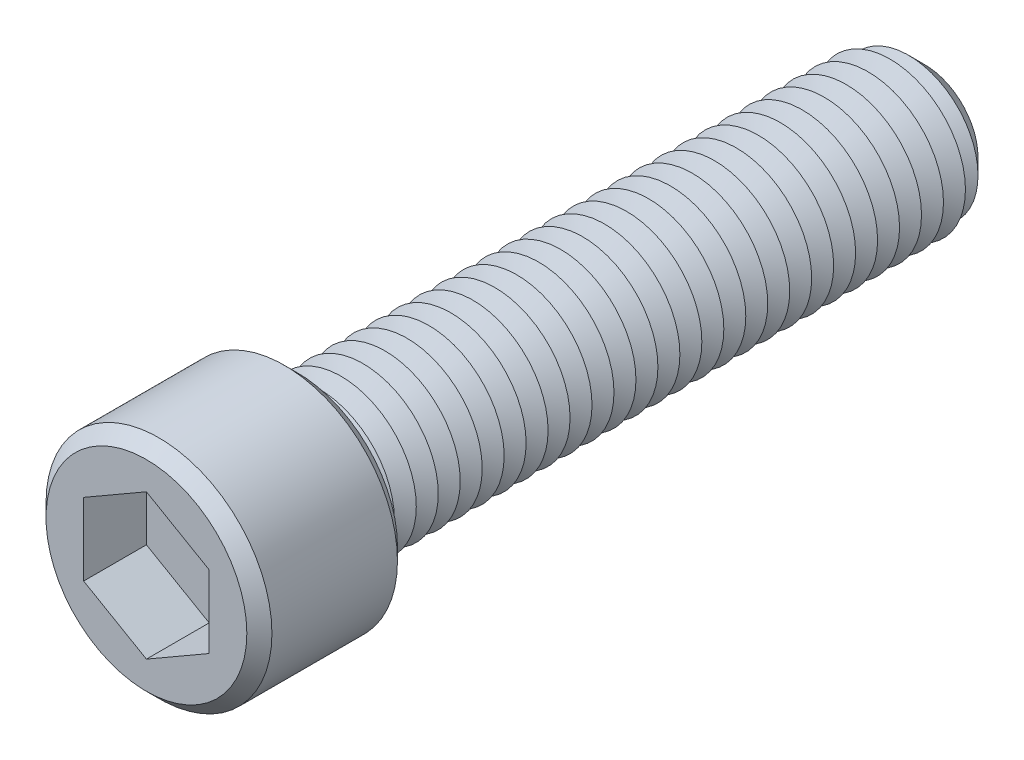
ISO-10303-21;
HEADER;
FILE_DESCRIPTION(('STEP AP214'),'2;1');
FILE_NAME('part.step','',(''),(''),'','','');
FILE_SCHEMA(('AUTOMOTIVE_DESIGN { 1 0 10303 214 1 1 1 1 }'));
ENDSEC;
DATA;
#1=APPLICATION_CONTEXT('core data for automotive mechanical design processes');
#2=APPLICATION_PROTOCOL_DEFINITION('international standard','automotive_design',2000,#1);
#3=PRODUCT_CONTEXT('',#1,'mechanical');
#4=PRODUCT('Part','Part','',(#3));
#5=PRODUCT_RELATED_PRODUCT_CATEGORY('part','',(#4));
#6=PRODUCT_DEFINITION_FORMATION('','',#4);
#7=PRODUCT_DEFINITION_CONTEXT('part definition',#1,'design');
#8=PRODUCT_DEFINITION('design','',#6,#7);
#9=PRODUCT_DEFINITION_SHAPE('','',#8);
#10=(LENGTH_UNIT() NAMED_UNIT(*) SI_UNIT(.MILLI.,.METRE.));
#11=(NAMED_UNIT(*) PLANE_ANGLE_UNIT() SI_UNIT($,.RADIAN.));
#12=(NAMED_UNIT(*) SI_UNIT($,.STERADIAN.) SOLID_ANGLE_UNIT());
#13=UNCERTAINTY_MEASURE_WITH_UNIT(LENGTH_MEASURE(1.E-05),#10,'distance_accuracy_value','');
#14=(GEOMETRIC_REPRESENTATION_CONTEXT(3) GLOBAL_UNCERTAINTY_ASSIGNED_CONTEXT((#13)) GLOBAL_UNIT_ASSIGNED_CONTEXT((#10,
#11,#12)) REPRESENTATION_CONTEXT('',''));
#15=CARTESIAN_POINT('',(0.,0.,0.));
#16=DIRECTION('',(0.,0.,1.));
#17=DIRECTION('',(1.,0.,0.));
#18=AXIS2_PLACEMENT_3D('',#15,#16,#17);
#19=CARTESIAN_POINT('',(0.,0.,12.));
#20=DIRECTION('',(0.,0.,-1.));
#21=DIRECTION('',(-1.,0.,0.));
#22=AXIS2_PLACEMENT_3D('',#19,#20,#21);
#23=CYLINDRICAL_SURFACE('',#22,9.);
#24=CARTESIAN_POINT('',(0.,0.,0.999999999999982));
#25=DIRECTION('',(0.,0.,1.));
#26=DIRECTION('',(1.,0.,0.));
#27=AXIS2_PLACEMENT_3D('',#24,#25,#26);
#28=CIRCLE('',#27,9.);
#29=CARTESIAN_POINT('',(9.,0.,0.999999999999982));
#30=VERTEX_POINT('',#29);
#31=EDGE_CURVE('E400',#30,#30,#28,.T.);
#32=ORIENTED_EDGE('',*,*,#31,.T.);
#33=EDGE_LOOP('',(#32));
#34=FACE_BOUND('',#33,.T.);
#35=CARTESIAN_POINT('',(0.,0.,11.));
#36=DIRECTION('',(0.,0.,1.));
#37=DIRECTION('',(1.,0.,0.));
#38=AXIS2_PLACEMENT_3D('',#35,#36,#37);
#39=CIRCLE('',#38,9.);
#40=CARTESIAN_POINT('',(9.,0.,11.));
#41=VERTEX_POINT('',#40);
#42=EDGE_CURVE('E393',#41,#41,#39,.F.);
#43=ORIENTED_EDGE('',*,*,#42,.T.);
#44=EDGE_LOOP('',(#43));
#45=FACE_BOUND('',#44,.T.);
#46=ADVANCED_FACE('F39',(#34,#45),#23,.T.);
#47=CARTESIAN_POINT('',(0.,0.,12.));
#48=DIRECTION('',(0.,0.,1.));
#49=DIRECTION('',(1.,0.,0.));
#50=AXIS2_PLACEMENT_3D('',#47,#48,#49);
#51=PLANE('',#50);
#52=CARTESIAN_POINT('',(0.,0.,12.));
#53=DIRECTION('',(0.,0.,1.));
#54=DIRECTION('',(1.,0.,0.));
#55=AXIS2_PLACEMENT_3D('',#52,#53,#54);
#56=CIRCLE('',#55,7.99999999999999);
#57=CARTESIAN_POINT('',(7.99999999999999,0.,12.));
#58=VERTEX_POINT('',#57);
#59=EDGE_CURVE('E11',#58,#58,#56,.T.);
#60=ORIENTED_EDGE('',*,*,#59,.T.);
#61=EDGE_LOOP('',(#60));
#62=FACE_BOUND('',#61,.T.);
#63=DIRECTION('',(-0.866025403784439,0.5,0.));
#64=VECTOR('',#63,1.);
#65=CARTESIAN_POINT('',(5.,2.88675134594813,12.));
#66=LINE('',#65,#64);
#67=CARTESIAN_POINT('',(5.,2.88675134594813,12.));
#68=VERTEX_POINT('',#67);
#69=CARTESIAN_POINT('',(0.,5.77350269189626,12.));
#70=VERTEX_POINT('',#69);
#71=EDGE_CURVE('E55',#68,#70,#66,.T.);
#72=ORIENTED_EDGE('',*,*,#71,.F.);
#73=DIRECTION('',(0.,1.,0.));
#74=VECTOR('',#73,1.);
#75=CARTESIAN_POINT('',(5.,-2.88675134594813,12.));
#76=LINE('',#75,#74);
#77=CARTESIAN_POINT('',(5.,-2.88675134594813,12.));
#78=VERTEX_POINT('',#77);
#79=EDGE_CURVE('E151',#78,#68,#76,.T.);
#80=ORIENTED_EDGE('',*,*,#79,.F.);
#81=DIRECTION('',(0.866025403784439,0.5,0.));
#82=VECTOR('',#81,1.);
#83=CARTESIAN_POINT('',(0.,-5.77350269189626,12.));
#84=LINE('',#83,#82);
#85=CARTESIAN_POINT('',(0.,-5.77350269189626,12.));
#86=VERTEX_POINT('',#85);
#87=EDGE_CURVE('E148',#86,#78,#84,.T.);
#88=ORIENTED_EDGE('',*,*,#87,.F.);
#89=DIRECTION('',(0.866025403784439,-0.5,0.));
#90=VECTOR('',#89,1.);
#91=CARTESIAN_POINT('',(-5.,-2.88675134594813,12.));
#92=LINE('',#91,#90);
#93=CARTESIAN_POINT('',(-5.,-2.88675134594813,12.));
#94=VERTEX_POINT('',#93);
#95=EDGE_CURVE('E103',#94,#86,#92,.T.);
#96=ORIENTED_EDGE('',*,*,#95,.F.);
#97=DIRECTION('',(0.,-1.,0.));
#98=VECTOR('',#97,1.);
#99=CARTESIAN_POINT('',(-5.,2.88675134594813,12.));
#100=LINE('',#99,#98);
#101=CARTESIAN_POINT('',(-5.,2.88675134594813,12.));
#102=VERTEX_POINT('',#101);
#103=EDGE_CURVE('E142',#102,#94,#100,.T.);
#104=ORIENTED_EDGE('',*,*,#103,.F.);
#105=DIRECTION('',(-0.866025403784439,-0.5,0.));
#106=VECTOR('',#105,1.);
#107=CARTESIAN_POINT('',(0.,5.77350269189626,12.));
#108=LINE('',#107,#106);
#109=EDGE_CURVE('E137',#70,#102,#108,.T.);
#110=ORIENTED_EDGE('',*,*,#109,.F.);
#111=EDGE_LOOP('',(#72,#80,#88,#96,#104,#110));
#112=FACE_BOUND('',#111,.T.);
#113=ADVANCED_FACE('F418',(#62,#112),#51,.T.);
#114=CARTESIAN_POINT('',(0.,0.,0.));
#115=DIRECTION('',(0.,0.,1.));
#116=DIRECTION('',(1.,0.,0.));
#117=AXIS2_PLACEMENT_3D('',#114,#115,#116);
#118=PLANE('',#117);
#119=CARTESIAN_POINT('',(0.,0.,0.));
#120=DIRECTION('',(0.,0.,1.));
#121=DIRECTION('',(1.,0.,0.));
#122=AXIS2_PLACEMENT_3D('',#119,#120,#121);
#123=CIRCLE('',#122,8.00000000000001);
#124=CARTESIAN_POINT('',(8.00000000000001,0.,0.));
#125=VERTEX_POINT('',#124);
#126=EDGE_CURVE('E48',#125,#125,#123,.F.);
#127=ORIENTED_EDGE('',*,*,#126,.T.);
#128=EDGE_LOOP('',(#127));
#129=FACE_BOUND('',#128,.T.);
#130=CARTESIAN_POINT('',(0.,0.,0.));
#131=DIRECTION('',(0.,0.,1.));
#132=DIRECTION('',(1.,0.,0.));
#133=AXIS2_PLACEMENT_3D('',#130,#131,#132);
#134=CIRCLE('',#133,6.);
#135=CARTESIAN_POINT('',(6.,0.,0.));
#136=VERTEX_POINT('',#135);
#137=EDGE_CURVE('E386',#136,#136,#134,.T.);
#138=ORIENTED_EDGE('',*,*,#137,.T.);
#139=EDGE_LOOP('',(#138));
#140=FACE_BOUND('',#139,.T.);
#141=ADVANCED_FACE('F407',(#129,#140),#118,.F.);
#142=CARTESIAN_POINT('',(0.,0.,0.));
#143=DIRECTION('',(0.,0.,1.));
#144=DIRECTION('',(1.,0.,0.));
#145=AXIS2_PLACEMENT_3D('',#142,#143,#144);
#146=CONICAL_SURFACE('',#145,6.,1.0471975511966);
#147=CARTESIAN_POINT('',(0.,0.,-0.875000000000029));
#148=DIRECTION('',(0.,0.,1.));
#149=DIRECTION('',(1.,0.,0.));
#150=AXIS2_PLACEMENT_3D('',#147,#148,#149);
#151=CIRCLE('',#150,4.48445554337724);
#152=CARTESIAN_POINT('',(4.48445554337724,0.,-0.875000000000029));
#153=VERTEX_POINT('',#152);
#154=EDGE_CURVE('E382',#153,#153,#151,.T.);
#155=ORIENTED_EDGE('',*,*,#154,.T.);
#156=EDGE_LOOP('',(#155));
#157=FACE_BOUND('',#156,.T.);
#158=ORIENTED_EDGE('',*,*,#137,.F.);
#159=EDGE_LOOP('',(#158));
#160=FACE_BOUND('',#159,.T.);
#161=ADVANCED_FACE('F692',(#157,#160),#146,.T.);
#162=CARTESIAN_POINT('',(0.,0.,-0.875000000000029));
#163=DIRECTION('',(0.,0.,-1.));
#164=DIRECTION('',(-1.,0.,0.));
#165=AXIS2_PLACEMENT_3D('',#162,#163,#164);
#166=CONICAL_SURFACE('',#165,4.48445554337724,1.0471975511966);
#167=CARTESIAN_POINT('',(0.,0.,-1.75000000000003));
#168=DIRECTION('',(0.,0.,1.));
#169=DIRECTION('',(1.,0.,0.));
#170=AXIS2_PLACEMENT_3D('',#167,#168,#169);
#171=CIRCLE('',#170,6.);
#172=CARTESIAN_POINT('',(6.,0.,-1.75000000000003));
#173=VERTEX_POINT('',#172);
#174=EDGE_CURVE('E378',#173,#173,#171,.T.);
#175=ORIENTED_EDGE('',*,*,#174,.T.);
#176=EDGE_LOOP('',(#175));
#177=FACE_BOUND('',#176,.T.);
#178=ORIENTED_EDGE('',*,*,#154,.F.);
#179=EDGE_LOOP('',(#178));
#180=FACE_BOUND('',#179,.T.);
#181=ADVANCED_FACE('F688',(#177,#180),#166,.T.);
#182=CARTESIAN_POINT('',(0.,0.,-1.75000000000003));
#183=DIRECTION('',(0.,0.,1.));
#184=DIRECTION('',(1.,0.,0.));
#185=AXIS2_PLACEMENT_3D('',#182,#183,#184);
#186=CONICAL_SURFACE('',#185,6.,1.0471975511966);
#187=CARTESIAN_POINT('',(0.,0.,-2.62500000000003));
#188=DIRECTION('',(0.,0.,1.));
#189=DIRECTION('',(1.,0.,0.));
#190=AXIS2_PLACEMENT_3D('',#187,#188,#189);
#191=CIRCLE('',#190,4.48445554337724);
#192=CARTESIAN_POINT('',(4.48445554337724,0.,-2.62500000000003));
#193=VERTEX_POINT('',#192);
#194=EDGE_CURVE('E374',#193,#193,#191,.T.);
#195=ORIENTED_EDGE('',*,*,#194,.T.);
#196=EDGE_LOOP('',(#195));
#197=FACE_BOUND('',#196,.T.);
#198=ORIENTED_EDGE('',*,*,#174,.F.);
#199=EDGE_LOOP('',(#198));
#200=FACE_BOUND('',#199,.T.);
#201=ADVANCED_FACE('F684',(#197,#200),#186,.T.);
#202=CARTESIAN_POINT('',(0.,0.,-2.62500000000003));
#203=DIRECTION('',(0.,0.,-1.));
#204=DIRECTION('',(-1.,0.,0.));
#205=AXIS2_PLACEMENT_3D('',#202,#203,#204);
#206=CONICAL_SURFACE('',#205,4.48445554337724,1.0471975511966);
#207=CARTESIAN_POINT('',(0.,0.,-3.50000000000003));
#208=DIRECTION('',(0.,0.,1.));
#209=DIRECTION('',(1.,0.,0.));
#210=AXIS2_PLACEMENT_3D('',#207,#208,#209);
#211=CIRCLE('',#210,6.);
#212=CARTESIAN_POINT('',(6.,0.,-3.50000000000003));
#213=VERTEX_POINT('',#212);
#214=EDGE_CURVE('E370',#213,#213,#211,.T.);
#215=ORIENTED_EDGE('',*,*,#214,.T.);
#216=EDGE_LOOP('',(#215));
#217=FACE_BOUND('',#216,.T.);
#218=ORIENTED_EDGE('',*,*,#194,.F.);
#219=EDGE_LOOP('',(#218));
#220=FACE_BOUND('',#219,.T.);
#221=ADVANCED_FACE('F680',(#217,#220),#206,.T.);
#222=CARTESIAN_POINT('',(0.,0.,-3.50000000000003));
#223=DIRECTION('',(0.,0.,1.));
#224=DIRECTION('',(1.,0.,0.));
#225=AXIS2_PLACEMENT_3D('',#222,#223,#224);
#226=CONICAL_SURFACE('',#225,6.,1.0471975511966);
#227=CARTESIAN_POINT('',(0.,0.,-4.37500000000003));
#228=DIRECTION('',(0.,0.,1.));
#229=DIRECTION('',(1.,0.,0.));
#230=AXIS2_PLACEMENT_3D('',#227,#228,#229);
#231=CIRCLE('',#230,4.48445554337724);
#232=CARTESIAN_POINT('',(4.48445554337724,0.,-4.37500000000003));
#233=VERTEX_POINT('',#232);
#234=EDGE_CURVE('E366',#233,#233,#231,.T.);
#235=ORIENTED_EDGE('',*,*,#234,.T.);
#236=EDGE_LOOP('',(#235));
#237=FACE_BOUND('',#236,.T.);
#238=ORIENTED_EDGE('',*,*,#214,.F.);
#239=EDGE_LOOP('',(#238));
#240=FACE_BOUND('',#239,.T.);
#241=ADVANCED_FACE('F676',(#237,#240),#226,.T.);
#242=CARTESIAN_POINT('',(0.,0.,-4.37500000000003));
#243=DIRECTION('',(0.,0.,-1.));
#244=DIRECTION('',(-1.,0.,0.));
#245=AXIS2_PLACEMENT_3D('',#242,#243,#244);
#246=CONICAL_SURFACE('',#245,4.48445554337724,1.0471975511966);
#247=CARTESIAN_POINT('',(0.,0.,-5.25000000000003));
#248=DIRECTION('',(0.,0.,1.));
#249=DIRECTION('',(1.,0.,0.));
#250=AXIS2_PLACEMENT_3D('',#247,#248,#249);
#251=CIRCLE('',#250,6.);
#252=CARTESIAN_POINT('',(6.,0.,-5.25000000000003));
#253=VERTEX_POINT('',#252);
#254=EDGE_CURVE('E362',#253,#253,#251,.T.);
#255=ORIENTED_EDGE('',*,*,#254,.T.);
#256=EDGE_LOOP('',(#255));
#257=FACE_BOUND('',#256,.T.);
#258=ORIENTED_EDGE('',*,*,#234,.F.);
#259=EDGE_LOOP('',(#258));
#260=FACE_BOUND('',#259,.T.);
#261=ADVANCED_FACE('F672',(#257,#260),#246,.T.);
#262=CARTESIAN_POINT('',(0.,0.,-5.25000000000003));
#263=DIRECTION('',(0.,0.,1.));
#264=DIRECTION('',(1.,0.,0.));
#265=AXIS2_PLACEMENT_3D('',#262,#263,#264);
#266=CONICAL_SURFACE('',#265,6.,1.0471975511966);
#267=CARTESIAN_POINT('',(0.,0.,-6.12500000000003));
#268=DIRECTION('',(0.,0.,1.));
#269=DIRECTION('',(1.,0.,0.));
#270=AXIS2_PLACEMENT_3D('',#267,#268,#269);
#271=CIRCLE('',#270,4.48445554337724);
#272=CARTESIAN_POINT('',(4.48445554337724,0.,-6.12500000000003));
#273=VERTEX_POINT('',#272);
#274=EDGE_CURVE('E358',#273,#273,#271,.T.);
#275=ORIENTED_EDGE('',*,*,#274,.T.);
#276=EDGE_LOOP('',(#275));
#277=FACE_BOUND('',#276,.T.);
#278=ORIENTED_EDGE('',*,*,#254,.F.);
#279=EDGE_LOOP('',(#278));
#280=FACE_BOUND('',#279,.T.);
#281=ADVANCED_FACE('F668',(#277,#280),#266,.T.);
#282=CARTESIAN_POINT('',(0.,0.,-6.12500000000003));
#283=DIRECTION('',(0.,0.,-1.));
#284=DIRECTION('',(-1.,0.,0.));
#285=AXIS2_PLACEMENT_3D('',#282,#283,#284);
#286=CONICAL_SURFACE('',#285,4.48445554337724,1.0471975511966);
#287=CARTESIAN_POINT('',(0.,0.,-7.00000000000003));
#288=DIRECTION('',(0.,0.,1.));
#289=DIRECTION('',(1.,0.,0.));
#290=AXIS2_PLACEMENT_3D('',#287,#288,#289);
#291=CIRCLE('',#290,6.);
#292=CARTESIAN_POINT('',(6.,0.,-7.00000000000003));
#293=VERTEX_POINT('',#292);
#294=EDGE_CURVE('E354',#293,#293,#291,.T.);
#295=ORIENTED_EDGE('',*,*,#294,.T.);
#296=EDGE_LOOP('',(#295));
#297=FACE_BOUND('',#296,.T.);
#298=ORIENTED_EDGE('',*,*,#274,.F.);
#299=EDGE_LOOP('',(#298));
#300=FACE_BOUND('',#299,.T.);
#301=ADVANCED_FACE('F664',(#297,#300),#286,.T.);
#302=CARTESIAN_POINT('',(0.,0.,-7.00000000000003));
#303=DIRECTION('',(0.,0.,1.));
#304=DIRECTION('',(1.,0.,0.));
#305=AXIS2_PLACEMENT_3D('',#302,#303,#304);
#306=CONICAL_SURFACE('',#305,6.,1.0471975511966);
#307=CARTESIAN_POINT('',(0.,0.,-7.87500000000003));
#308=DIRECTION('',(0.,0.,1.));
#309=DIRECTION('',(1.,0.,0.));
#310=AXIS2_PLACEMENT_3D('',#307,#308,#309);
#311=CIRCLE('',#310,4.48445554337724);
#312=CARTESIAN_POINT('',(4.48445554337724,0.,-7.87500000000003));
#313=VERTEX_POINT('',#312);
#314=EDGE_CURVE('E350',#313,#313,#311,.T.);
#315=ORIENTED_EDGE('',*,*,#314,.T.);
#316=EDGE_LOOP('',(#315));
#317=FACE_BOUND('',#316,.T.);
#318=ORIENTED_EDGE('',*,*,#294,.F.);
#319=EDGE_LOOP('',(#318));
#320=FACE_BOUND('',#319,.T.);
#321=ADVANCED_FACE('F660',(#317,#320),#306,.T.);
#322=CARTESIAN_POINT('',(0.,0.,-7.87500000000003));
#323=DIRECTION('',(0.,0.,-1.));
#324=DIRECTION('',(-1.,0.,0.));
#325=AXIS2_PLACEMENT_3D('',#322,#323,#324);
#326=CONICAL_SURFACE('',#325,4.48445554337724,1.0471975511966);
#327=CARTESIAN_POINT('',(0.,0.,-8.75000000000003));
#328=DIRECTION('',(0.,0.,1.));
#329=DIRECTION('',(1.,0.,0.));
#330=AXIS2_PLACEMENT_3D('',#327,#328,#329);
#331=CIRCLE('',#330,6.);
#332=CARTESIAN_POINT('',(6.,0.,-8.75000000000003));
#333=VERTEX_POINT('',#332);
#334=EDGE_CURVE('E346',#333,#333,#331,.T.);
#335=ORIENTED_EDGE('',*,*,#334,.T.);
#336=EDGE_LOOP('',(#335));
#337=FACE_BOUND('',#336,.T.);
#338=ORIENTED_EDGE('',*,*,#314,.F.);
#339=EDGE_LOOP('',(#338));
#340=FACE_BOUND('',#339,.T.);
#341=ADVANCED_FACE('F656',(#337,#340),#326,.T.);
#342=CARTESIAN_POINT('',(0.,0.,-8.75000000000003));
#343=DIRECTION('',(0.,0.,1.));
#344=DIRECTION('',(1.,0.,0.));
#345=AXIS2_PLACEMENT_3D('',#342,#343,#344);
#346=CONICAL_SURFACE('',#345,6.,1.0471975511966);
#347=CARTESIAN_POINT('',(0.,0.,-9.62500000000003));
#348=DIRECTION('',(0.,0.,1.));
#349=DIRECTION('',(1.,0.,0.));
#350=AXIS2_PLACEMENT_3D('',#347,#348,#349);
#351=CIRCLE('',#350,4.48445554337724);
#352=CARTESIAN_POINT('',(4.48445554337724,0.,-9.62500000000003));
#353=VERTEX_POINT('',#352);
#354=EDGE_CURVE('E342',#353,#353,#351,.T.);
#355=ORIENTED_EDGE('',*,*,#354,.T.);
#356=EDGE_LOOP('',(#355));
#357=FACE_BOUND('',#356,.T.);
#358=ORIENTED_EDGE('',*,*,#334,.F.);
#359=EDGE_LOOP('',(#358));
#360=FACE_BOUND('',#359,.T.);
#361=ADVANCED_FACE('F652',(#357,#360),#346,.T.);
#362=CARTESIAN_POINT('',(0.,0.,-9.62500000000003));
#363=DIRECTION('',(0.,0.,-1.));
#364=DIRECTION('',(-1.,0.,0.));
#365=AXIS2_PLACEMENT_3D('',#362,#363,#364);
#366=CONICAL_SURFACE('',#365,4.48445554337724,1.0471975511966);
#367=CARTESIAN_POINT('',(0.,0.,-10.5));
#368=DIRECTION('',(0.,0.,1.));
#369=DIRECTION('',(1.,0.,0.));
#370=AXIS2_PLACEMENT_3D('',#367,#368,#369);
#371=CIRCLE('',#370,6.);
#372=CARTESIAN_POINT('',(6.,0.,-10.5));
#373=VERTEX_POINT('',#372);
#374=EDGE_CURVE('E338',#373,#373,#371,.T.);
#375=ORIENTED_EDGE('',*,*,#374,.T.);
#376=EDGE_LOOP('',(#375));
#377=FACE_BOUND('',#376,.T.);
#378=ORIENTED_EDGE('',*,*,#354,.F.);
#379=EDGE_LOOP('',(#378));
#380=FACE_BOUND('',#379,.T.);
#381=ADVANCED_FACE('F648',(#377,#380),#366,.T.);
#382=CARTESIAN_POINT('',(0.,0.,-10.5));
#383=DIRECTION('',(0.,0.,1.));
#384=DIRECTION('',(1.,0.,0.));
#385=AXIS2_PLACEMENT_3D('',#382,#383,#384);
#386=CONICAL_SURFACE('',#385,6.,1.0471975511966);
#387=CARTESIAN_POINT('',(0.,0.,-11.375));
#388=DIRECTION('',(0.,0.,1.));
#389=DIRECTION('',(1.,0.,0.));
#390=AXIS2_PLACEMENT_3D('',#387,#388,#389);
#391=CIRCLE('',#390,4.48445554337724);
#392=CARTESIAN_POINT('',(4.48445554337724,0.,-11.375));
#393=VERTEX_POINT('',#392);
#394=EDGE_CURVE('E334',#393,#393,#391,.T.);
#395=ORIENTED_EDGE('',*,*,#394,.T.);
#396=EDGE_LOOP('',(#395));
#397=FACE_BOUND('',#396,.T.);
#398=ORIENTED_EDGE('',*,*,#374,.F.);
#399=EDGE_LOOP('',(#398));
#400=FACE_BOUND('',#399,.T.);
#401=ADVANCED_FACE('F644',(#397,#400),#386,.T.);
#402=CARTESIAN_POINT('',(0.,0.,-11.375));
#403=DIRECTION('',(0.,0.,-1.));
#404=DIRECTION('',(-1.,0.,0.));
#405=AXIS2_PLACEMENT_3D('',#402,#403,#404);
#406=CONICAL_SURFACE('',#405,4.48445554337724,1.0471975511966);
#407=CARTESIAN_POINT('',(0.,0.,-12.25));
#408=DIRECTION('',(0.,0.,1.));
#409=DIRECTION('',(1.,0.,0.));
#410=AXIS2_PLACEMENT_3D('',#407,#408,#409);
#411=CIRCLE('',#410,6.);
#412=CARTESIAN_POINT('',(6.,0.,-12.25));
#413=VERTEX_POINT('',#412);
#414=EDGE_CURVE('E330',#413,#413,#411,.T.);
#415=ORIENTED_EDGE('',*,*,#414,.T.);
#416=EDGE_LOOP('',(#415));
#417=FACE_BOUND('',#416,.T.);
#418=ORIENTED_EDGE('',*,*,#394,.F.);
#419=EDGE_LOOP('',(#418));
#420=FACE_BOUND('',#419,.T.);
#421=ADVANCED_FACE('F640',(#417,#420),#406,.T.);
#422=CARTESIAN_POINT('',(0.,0.,-12.25));
#423=DIRECTION('',(0.,0.,1.));
#424=DIRECTION('',(1.,0.,0.));
#425=AXIS2_PLACEMENT_3D('',#422,#423,#424);
#426=CONICAL_SURFACE('',#425,6.,1.0471975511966);
#427=CARTESIAN_POINT('',(0.,0.,-13.125));
#428=DIRECTION('',(0.,0.,1.));
#429=DIRECTION('',(1.,0.,0.));
#430=AXIS2_PLACEMENT_3D('',#427,#428,#429);
#431=CIRCLE('',#430,4.48445554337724);
#432=CARTESIAN_POINT('',(4.48445554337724,0.,-13.125));
#433=VERTEX_POINT('',#432);
#434=EDGE_CURVE('E326',#433,#433,#431,.T.);
#435=ORIENTED_EDGE('',*,*,#434,.T.);
#436=EDGE_LOOP('',(#435));
#437=FACE_BOUND('',#436,.T.);
#438=ORIENTED_EDGE('',*,*,#414,.F.);
#439=EDGE_LOOP('',(#438));
#440=FACE_BOUND('',#439,.T.);
#441=ADVANCED_FACE('F636',(#437,#440),#426,.T.);
#442=CARTESIAN_POINT('',(0.,0.,-13.125));
#443=DIRECTION('',(0.,0.,-1.));
#444=DIRECTION('',(-1.,0.,0.));
#445=AXIS2_PLACEMENT_3D('',#442,#443,#444);
#446=CONICAL_SURFACE('',#445,4.48445554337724,1.0471975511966);
#447=CARTESIAN_POINT('',(0.,0.,-14.));
#448=DIRECTION('',(0.,0.,1.));
#449=DIRECTION('',(1.,0.,0.));
#450=AXIS2_PLACEMENT_3D('',#447,#448,#449);
#451=CIRCLE('',#450,6.);
#452=CARTESIAN_POINT('',(6.,0.,-14.));
#453=VERTEX_POINT('',#452);
#454=EDGE_CURVE('E322',#453,#453,#451,.T.);
#455=ORIENTED_EDGE('',*,*,#454,.T.);
#456=EDGE_LOOP('',(#455));
#457=FACE_BOUND('',#456,.T.);
#458=ORIENTED_EDGE('',*,*,#434,.F.);
#459=EDGE_LOOP('',(#458));
#460=FACE_BOUND('',#459,.T.);
#461=ADVANCED_FACE('F632',(#457,#460),#446,.T.);
#462=CARTESIAN_POINT('',(0.,0.,-14.));
#463=DIRECTION('',(0.,0.,1.));
#464=DIRECTION('',(1.,0.,0.));
#465=AXIS2_PLACEMENT_3D('',#462,#463,#464);
#466=CONICAL_SURFACE('',#465,6.,1.0471975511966);
#467=CARTESIAN_POINT('',(0.,0.,-14.875));
#468=DIRECTION('',(0.,0.,1.));
#469=DIRECTION('',(1.,0.,0.));
#470=AXIS2_PLACEMENT_3D('',#467,#468,#469);
#471=CIRCLE('',#470,4.48445554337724);
#472=CARTESIAN_POINT('',(4.48445554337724,0.,-14.875));
#473=VERTEX_POINT('',#472);
#474=EDGE_CURVE('E318',#473,#473,#471,.T.);
#475=ORIENTED_EDGE('',*,*,#474,.T.);
#476=EDGE_LOOP('',(#475));
#477=FACE_BOUND('',#476,.T.);
#478=ORIENTED_EDGE('',*,*,#454,.F.);
#479=EDGE_LOOP('',(#478));
#480=FACE_BOUND('',#479,.T.);
#481=ADVANCED_FACE('F628',(#477,#480),#466,.T.);
#482=CARTESIAN_POINT('',(0.,0.,-14.875));
#483=DIRECTION('',(0.,0.,-1.));
#484=DIRECTION('',(-1.,0.,0.));
#485=AXIS2_PLACEMENT_3D('',#482,#483,#484);
#486=CONICAL_SURFACE('',#485,4.48445554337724,1.0471975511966);
#487=CARTESIAN_POINT('',(0.,0.,-15.75));
#488=DIRECTION('',(0.,0.,1.));
#489=DIRECTION('',(1.,0.,0.));
#490=AXIS2_PLACEMENT_3D('',#487,#488,#489);
#491=CIRCLE('',#490,6.);
#492=CARTESIAN_POINT('',(6.,0.,-15.75));
#493=VERTEX_POINT('',#492);
#494=EDGE_CURVE('E314',#493,#493,#491,.T.);
#495=ORIENTED_EDGE('',*,*,#494,.T.);
#496=EDGE_LOOP('',(#495));
#497=FACE_BOUND('',#496,.T.);
#498=ORIENTED_EDGE('',*,*,#474,.F.);
#499=EDGE_LOOP('',(#498));
#500=FACE_BOUND('',#499,.T.);
#501=ADVANCED_FACE('F624',(#497,#500),#486,.T.);
#502=CARTESIAN_POINT('',(0.,0.,-15.75));
#503=DIRECTION('',(0.,0.,1.));
#504=DIRECTION('',(1.,0.,0.));
#505=AXIS2_PLACEMENT_3D('',#502,#503,#504);
#506=CONICAL_SURFACE('',#505,6.,1.0471975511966);
#507=CARTESIAN_POINT('',(0.,0.,-16.625));
#508=DIRECTION('',(0.,0.,1.));
#509=DIRECTION('',(1.,0.,0.));
#510=AXIS2_PLACEMENT_3D('',#507,#508,#509);
#511=CIRCLE('',#510,4.48445554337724);
#512=CARTESIAN_POINT('',(4.48445554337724,0.,-16.625));
#513=VERTEX_POINT('',#512);
#514=EDGE_CURVE('E310',#513,#513,#511,.T.);
#515=ORIENTED_EDGE('',*,*,#514,.T.);
#516=EDGE_LOOP('',(#515));
#517=FACE_BOUND('',#516,.T.);
#518=ORIENTED_EDGE('',*,*,#494,.F.);
#519=EDGE_LOOP('',(#518));
#520=FACE_BOUND('',#519,.T.);
#521=ADVANCED_FACE('F620',(#517,#520),#506,.T.);
#522=CARTESIAN_POINT('',(0.,0.,-16.625));
#523=DIRECTION('',(0.,0.,-1.));
#524=DIRECTION('',(-1.,0.,0.));
#525=AXIS2_PLACEMENT_3D('',#522,#523,#524);
#526=CONICAL_SURFACE('',#525,4.48445554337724,1.0471975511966);
#527=CARTESIAN_POINT('',(0.,0.,-17.5));
#528=DIRECTION('',(0.,0.,1.));
#529=DIRECTION('',(1.,0.,0.));
#530=AXIS2_PLACEMENT_3D('',#527,#528,#529);
#531=CIRCLE('',#530,6.);
#532=CARTESIAN_POINT('',(6.,0.,-17.5));
#533=VERTEX_POINT('',#532);
#534=EDGE_CURVE('E306',#533,#533,#531,.T.);
#535=ORIENTED_EDGE('',*,*,#534,.T.);
#536=EDGE_LOOP('',(#535));
#537=FACE_BOUND('',#536,.T.);
#538=ORIENTED_EDGE('',*,*,#514,.F.);
#539=EDGE_LOOP('',(#538));
#540=FACE_BOUND('',#539,.T.);
#541=ADVANCED_FACE('F616',(#537,#540),#526,.T.);
#542=CARTESIAN_POINT('',(0.,0.,-17.5));
#543=DIRECTION('',(0.,0.,1.));
#544=DIRECTION('',(1.,0.,0.));
#545=AXIS2_PLACEMENT_3D('',#542,#543,#544);
#546=CONICAL_SURFACE('',#545,6.,1.0471975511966);
#547=CARTESIAN_POINT('',(0.,0.,-18.375));
#548=DIRECTION('',(0.,0.,1.));
#549=DIRECTION('',(1.,0.,0.));
#550=AXIS2_PLACEMENT_3D('',#547,#548,#549);
#551=CIRCLE('',#550,4.48445554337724);
#552=CARTESIAN_POINT('',(4.48445554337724,0.,-18.375));
#553=VERTEX_POINT('',#552);
#554=EDGE_CURVE('E302',#553,#553,#551,.T.);
#555=ORIENTED_EDGE('',*,*,#554,.T.);
#556=EDGE_LOOP('',(#555));
#557=FACE_BOUND('',#556,.T.);
#558=ORIENTED_EDGE('',*,*,#534,.F.);
#559=EDGE_LOOP('',(#558));
#560=FACE_BOUND('',#559,.T.);
#561=ADVANCED_FACE('F612',(#557,#560),#546,.T.);
#562=CARTESIAN_POINT('',(0.,0.,-18.375));
#563=DIRECTION('',(0.,0.,-1.));
#564=DIRECTION('',(-1.,0.,0.));
#565=AXIS2_PLACEMENT_3D('',#562,#563,#564);
#566=CONICAL_SURFACE('',#565,4.48445554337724,1.0471975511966);
#567=CARTESIAN_POINT('',(0.,0.,-19.25));
#568=DIRECTION('',(0.,0.,1.));
#569=DIRECTION('',(1.,0.,0.));
#570=AXIS2_PLACEMENT_3D('',#567,#568,#569);
#571=CIRCLE('',#570,6.);
#572=CARTESIAN_POINT('',(6.,0.,-19.25));
#573=VERTEX_POINT('',#572);
#574=EDGE_CURVE('E298',#573,#573,#571,.T.);
#575=ORIENTED_EDGE('',*,*,#574,.T.);
#576=EDGE_LOOP('',(#575));
#577=FACE_BOUND('',#576,.T.);
#578=ORIENTED_EDGE('',*,*,#554,.F.);
#579=EDGE_LOOP('',(#578));
#580=FACE_BOUND('',#579,.T.);
#581=ADVANCED_FACE('F608',(#577,#580),#566,.T.);
#582=CARTESIAN_POINT('',(0.,0.,-19.25));
#583=DIRECTION('',(0.,0.,1.));
#584=DIRECTION('',(1.,0.,0.));
#585=AXIS2_PLACEMENT_3D('',#582,#583,#584);
#586=CONICAL_SURFACE('',#585,6.,1.0471975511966);
#587=CARTESIAN_POINT('',(0.,0.,-20.125));
#588=DIRECTION('',(0.,0.,1.));
#589=DIRECTION('',(1.,0.,0.));
#590=AXIS2_PLACEMENT_3D('',#587,#588,#589);
#591=CIRCLE('',#590,4.48445554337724);
#592=CARTESIAN_POINT('',(4.48445554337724,0.,-20.125));
#593=VERTEX_POINT('',#592);
#594=EDGE_CURVE('E294',#593,#593,#591,.T.);
#595=ORIENTED_EDGE('',*,*,#594,.T.);
#596=EDGE_LOOP('',(#595));
#597=FACE_BOUND('',#596,.T.);
#598=ORIENTED_EDGE('',*,*,#574,.F.);
#599=EDGE_LOOP('',(#598));
#600=FACE_BOUND('',#599,.T.);
#601=ADVANCED_FACE('F604',(#597,#600),#586,.T.);
#602=CARTESIAN_POINT('',(0.,0.,-20.125));
#603=DIRECTION('',(0.,0.,-1.));
#604=DIRECTION('',(-1.,0.,0.));
#605=AXIS2_PLACEMENT_3D('',#602,#603,#604);
#606=CONICAL_SURFACE('',#605,4.48445554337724,1.0471975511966);
#607=CARTESIAN_POINT('',(0.,0.,-21.));
#608=DIRECTION('',(0.,0.,1.));
#609=DIRECTION('',(1.,0.,0.));
#610=AXIS2_PLACEMENT_3D('',#607,#608,#609);
#611=CIRCLE('',#610,6.);
#612=CARTESIAN_POINT('',(6.,0.,-21.));
#613=VERTEX_POINT('',#612);
#614=EDGE_CURVE('E290',#613,#613,#611,.T.);
#615=ORIENTED_EDGE('',*,*,#614,.T.);
#616=EDGE_LOOP('',(#615));
#617=FACE_BOUND('',#616,.T.);
#618=ORIENTED_EDGE('',*,*,#594,.F.);
#619=EDGE_LOOP('',(#618));
#620=FACE_BOUND('',#619,.T.);
#621=ADVANCED_FACE('F600',(#617,#620),#606,.T.);
#622=CARTESIAN_POINT('',(0.,0.,-21.));
#623=DIRECTION('',(0.,0.,1.));
#624=DIRECTION('',(1.,0.,0.));
#625=AXIS2_PLACEMENT_3D('',#622,#623,#624);
#626=CONICAL_SURFACE('',#625,6.,1.0471975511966);
#627=CARTESIAN_POINT('',(0.,0.,-21.875));
#628=DIRECTION('',(0.,0.,1.));
#629=DIRECTION('',(1.,0.,0.));
#630=AXIS2_PLACEMENT_3D('',#627,#628,#629);
#631=CIRCLE('',#630,4.48445554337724);
#632=CARTESIAN_POINT('',(4.48445554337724,0.,-21.875));
#633=VERTEX_POINT('',#632);
#634=EDGE_CURVE('E286',#633,#633,#631,.T.);
#635=ORIENTED_EDGE('',*,*,#634,.T.);
#636=EDGE_LOOP('',(#635));
#637=FACE_BOUND('',#636,.T.);
#638=ORIENTED_EDGE('',*,*,#614,.F.);
#639=EDGE_LOOP('',(#638));
#640=FACE_BOUND('',#639,.T.);
#641=ADVANCED_FACE('F596',(#637,#640),#626,.T.);
#642=CARTESIAN_POINT('',(0.,0.,-21.875));
#643=DIRECTION('',(0.,0.,-1.));
#644=DIRECTION('',(-1.,0.,0.));
#645=AXIS2_PLACEMENT_3D('',#642,#643,#644);
#646=CONICAL_SURFACE('',#645,4.48445554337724,1.0471975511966);
#647=CARTESIAN_POINT('',(0.,0.,-22.75));
#648=DIRECTION('',(0.,0.,1.));
#649=DIRECTION('',(1.,0.,0.));
#650=AXIS2_PLACEMENT_3D('',#647,#648,#649);
#651=CIRCLE('',#650,6.);
#652=CARTESIAN_POINT('',(6.,0.,-22.75));
#653=VERTEX_POINT('',#652);
#654=EDGE_CURVE('E282',#653,#653,#651,.T.);
#655=ORIENTED_EDGE('',*,*,#654,.T.);
#656=EDGE_LOOP('',(#655));
#657=FACE_BOUND('',#656,.T.);
#658=ORIENTED_EDGE('',*,*,#634,.F.);
#659=EDGE_LOOP('',(#658));
#660=FACE_BOUND('',#659,.T.);
#661=ADVANCED_FACE('F592',(#657,#660),#646,.T.);
#662=CARTESIAN_POINT('',(0.,0.,-22.75));
#663=DIRECTION('',(0.,0.,1.));
#664=DIRECTION('',(1.,0.,0.));
#665=AXIS2_PLACEMENT_3D('',#662,#663,#664);
#666=CONICAL_SURFACE('',#665,6.,1.0471975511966);
#667=CARTESIAN_POINT('',(0.,0.,-23.625));
#668=DIRECTION('',(0.,0.,1.));
#669=DIRECTION('',(1.,0.,0.));
#670=AXIS2_PLACEMENT_3D('',#667,#668,#669);
#671=CIRCLE('',#670,4.48445554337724);
#672=CARTESIAN_POINT('',(4.48445554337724,0.,-23.625));
#673=VERTEX_POINT('',#672);
#674=EDGE_CURVE('E278',#673,#673,#671,.T.);
#675=ORIENTED_EDGE('',*,*,#674,.T.);
#676=EDGE_LOOP('',(#675));
#677=FACE_BOUND('',#676,.T.);
#678=ORIENTED_EDGE('',*,*,#654,.F.);
#679=EDGE_LOOP('',(#678));
#680=FACE_BOUND('',#679,.T.);
#681=ADVANCED_FACE('F588',(#677,#680),#666,.T.);
#682=CARTESIAN_POINT('',(0.,0.,-23.625));
#683=DIRECTION('',(0.,0.,-1.));
#684=DIRECTION('',(-1.,0.,0.));
#685=AXIS2_PLACEMENT_3D('',#682,#683,#684);
#686=CONICAL_SURFACE('',#685,4.48445554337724,1.0471975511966);
#687=CARTESIAN_POINT('',(0.,0.,-24.5));
#688=DIRECTION('',(0.,0.,1.));
#689=DIRECTION('',(1.,0.,0.));
#690=AXIS2_PLACEMENT_3D('',#687,#688,#689);
#691=CIRCLE('',#690,6.);
#692=CARTESIAN_POINT('',(6.,0.,-24.5));
#693=VERTEX_POINT('',#692);
#694=EDGE_CURVE('E274',#693,#693,#691,.T.);
#695=ORIENTED_EDGE('',*,*,#694,.T.);
#696=EDGE_LOOP('',(#695));
#697=FACE_BOUND('',#696,.T.);
#698=ORIENTED_EDGE('',*,*,#674,.F.);
#699=EDGE_LOOP('',(#698));
#700=FACE_BOUND('',#699,.T.);
#701=ADVANCED_FACE('F584',(#697,#700),#686,.T.);
#702=CARTESIAN_POINT('',(0.,0.,-24.5));
#703=DIRECTION('',(0.,0.,1.));
#704=DIRECTION('',(1.,0.,0.));
#705=AXIS2_PLACEMENT_3D('',#702,#703,#704);
#706=CONICAL_SURFACE('',#705,6.,1.0471975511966);
#707=CARTESIAN_POINT('',(0.,0.,-25.375));
#708=DIRECTION('',(0.,0.,1.));
#709=DIRECTION('',(1.,0.,0.));
#710=AXIS2_PLACEMENT_3D('',#707,#708,#709);
#711=CIRCLE('',#710,4.48445554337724);
#712=CARTESIAN_POINT('',(4.48445554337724,0.,-25.375));
#713=VERTEX_POINT('',#712);
#714=EDGE_CURVE('E270',#713,#713,#711,.T.);
#715=ORIENTED_EDGE('',*,*,#714,.T.);
#716=EDGE_LOOP('',(#715));
#717=FACE_BOUND('',#716,.T.);
#718=ORIENTED_EDGE('',*,*,#694,.F.);
#719=EDGE_LOOP('',(#718));
#720=FACE_BOUND('',#719,.T.);
#721=ADVANCED_FACE('F580',(#717,#720),#706,.T.);
#722=CARTESIAN_POINT('',(0.,0.,-25.375));
#723=DIRECTION('',(0.,0.,-1.));
#724=DIRECTION('',(-1.,0.,0.));
#725=AXIS2_PLACEMENT_3D('',#722,#723,#724);
#726=CONICAL_SURFACE('',#725,4.48445554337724,1.0471975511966);
#727=CARTESIAN_POINT('',(0.,0.,-26.25));
#728=DIRECTION('',(0.,0.,1.));
#729=DIRECTION('',(1.,0.,0.));
#730=AXIS2_PLACEMENT_3D('',#727,#728,#729);
#731=CIRCLE('',#730,6.);
#732=CARTESIAN_POINT('',(6.,0.,-26.25));
#733=VERTEX_POINT('',#732);
#734=EDGE_CURVE('E266',#733,#733,#731,.T.);
#735=ORIENTED_EDGE('',*,*,#734,.T.);
#736=EDGE_LOOP('',(#735));
#737=FACE_BOUND('',#736,.T.);
#738=ORIENTED_EDGE('',*,*,#714,.F.);
#739=EDGE_LOOP('',(#738));
#740=FACE_BOUND('',#739,.T.);
#741=ADVANCED_FACE('F576',(#737,#740),#726,.T.);
#742=CARTESIAN_POINT('',(0.,0.,-26.25));
#743=DIRECTION('',(0.,0.,1.));
#744=DIRECTION('',(1.,0.,0.));
#745=AXIS2_PLACEMENT_3D('',#742,#743,#744);
#746=CONICAL_SURFACE('',#745,6.,1.0471975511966);
#747=CARTESIAN_POINT('',(0.,0.,-27.125));
#748=DIRECTION('',(0.,0.,1.));
#749=DIRECTION('',(1.,0.,0.));
#750=AXIS2_PLACEMENT_3D('',#747,#748,#749);
#751=CIRCLE('',#750,4.48445554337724);
#752=CARTESIAN_POINT('',(4.48445554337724,0.,-27.125));
#753=VERTEX_POINT('',#752);
#754=EDGE_CURVE('E262',#753,#753,#751,.T.);
#755=ORIENTED_EDGE('',*,*,#754,.T.);
#756=EDGE_LOOP('',(#755));
#757=FACE_BOUND('',#756,.T.);
#758=ORIENTED_EDGE('',*,*,#734,.F.);
#759=EDGE_LOOP('',(#758));
#760=FACE_BOUND('',#759,.T.);
#761=ADVANCED_FACE('F572',(#757,#760),#746,.T.);
#762=CARTESIAN_POINT('',(0.,0.,-27.125));
#763=DIRECTION('',(0.,0.,-1.));
#764=DIRECTION('',(-1.,0.,0.));
#765=AXIS2_PLACEMENT_3D('',#762,#763,#764);
#766=CONICAL_SURFACE('',#765,4.48445554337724,1.0471975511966);
#767=CARTESIAN_POINT('',(0.,0.,-28.));
#768=DIRECTION('',(0.,0.,1.));
#769=DIRECTION('',(1.,0.,0.));
#770=AXIS2_PLACEMENT_3D('',#767,#768,#769);
#771=CIRCLE('',#770,6.);
#772=CARTESIAN_POINT('',(6.,0.,-28.));
#773=VERTEX_POINT('',#772);
#774=EDGE_CURVE('E258',#773,#773,#771,.T.);
#775=ORIENTED_EDGE('',*,*,#774,.T.);
#776=EDGE_LOOP('',(#775));
#777=FACE_BOUND('',#776,.T.);
#778=ORIENTED_EDGE('',*,*,#754,.F.);
#779=EDGE_LOOP('',(#778));
#780=FACE_BOUND('',#779,.T.);
#781=ADVANCED_FACE('F568',(#777,#780),#766,.T.);
#782=CARTESIAN_POINT('',(0.,0.,-28.));
#783=DIRECTION('',(0.,0.,1.));
#784=DIRECTION('',(1.,0.,0.));
#785=AXIS2_PLACEMENT_3D('',#782,#783,#784);
#786=CONICAL_SURFACE('',#785,6.,1.0471975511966);
#787=CARTESIAN_POINT('',(0.,0.,-28.875));
#788=DIRECTION('',(0.,0.,1.));
#789=DIRECTION('',(1.,0.,0.));
#790=AXIS2_PLACEMENT_3D('',#787,#788,#789);
#791=CIRCLE('',#790,4.48445554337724);
#792=CARTESIAN_POINT('',(4.48445554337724,0.,-28.875));
#793=VERTEX_POINT('',#792);
#794=EDGE_CURVE('E254',#793,#793,#791,.T.);
#795=ORIENTED_EDGE('',*,*,#794,.T.);
#796=EDGE_LOOP('',(#795));
#797=FACE_BOUND('',#796,.T.);
#798=ORIENTED_EDGE('',*,*,#774,.F.);
#799=EDGE_LOOP('',(#798));
#800=FACE_BOUND('',#799,.T.);
#801=ADVANCED_FACE('F564',(#797,#800),#786,.T.);
#802=CARTESIAN_POINT('',(0.,0.,-28.875));
#803=DIRECTION('',(0.,0.,-1.));
#804=DIRECTION('',(-1.,0.,0.));
#805=AXIS2_PLACEMENT_3D('',#802,#803,#804);
#806=CONICAL_SURFACE('',#805,4.48445554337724,1.0471975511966);
#807=CARTESIAN_POINT('',(0.,0.,-29.75));
#808=DIRECTION('',(0.,0.,1.));
#809=DIRECTION('',(1.,0.,0.));
#810=AXIS2_PLACEMENT_3D('',#807,#808,#809);
#811=CIRCLE('',#810,6.);
#812=CARTESIAN_POINT('',(6.,0.,-29.75));
#813=VERTEX_POINT('',#812);
#814=EDGE_CURVE('E250',#813,#813,#811,.T.);
#815=ORIENTED_EDGE('',*,*,#814,.T.);
#816=EDGE_LOOP('',(#815));
#817=FACE_BOUND('',#816,.T.);
#818=ORIENTED_EDGE('',*,*,#794,.F.);
#819=EDGE_LOOP('',(#818));
#820=FACE_BOUND('',#819,.T.);
#821=ADVANCED_FACE('F560',(#817,#820),#806,.T.);
#822=CARTESIAN_POINT('',(0.,0.,-29.75));
#823=DIRECTION('',(0.,0.,1.));
#824=DIRECTION('',(1.,0.,0.));
#825=AXIS2_PLACEMENT_3D('',#822,#823,#824);
#826=CONICAL_SURFACE('',#825,6.,1.0471975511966);
#827=CARTESIAN_POINT('',(0.,0.,-30.625));
#828=DIRECTION('',(0.,0.,1.));
#829=DIRECTION('',(1.,0.,0.));
#830=AXIS2_PLACEMENT_3D('',#827,#828,#829);
#831=CIRCLE('',#830,4.48445554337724);
#832=CARTESIAN_POINT('',(4.48445554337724,0.,-30.625));
#833=VERTEX_POINT('',#832);
#834=EDGE_CURVE('E246',#833,#833,#831,.T.);
#835=ORIENTED_EDGE('',*,*,#834,.T.);
#836=EDGE_LOOP('',(#835));
#837=FACE_BOUND('',#836,.T.);
#838=ORIENTED_EDGE('',*,*,#814,.F.);
#839=EDGE_LOOP('',(#838));
#840=FACE_BOUND('',#839,.T.);
#841=ADVANCED_FACE('F556',(#837,#840),#826,.T.);
#842=CARTESIAN_POINT('',(0.,0.,-30.625));
#843=DIRECTION('',(0.,0.,-1.));
#844=DIRECTION('',(-1.,0.,0.));
#845=AXIS2_PLACEMENT_3D('',#842,#843,#844);
#846=CONICAL_SURFACE('',#845,4.48445554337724,1.0471975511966);
#847=CARTESIAN_POINT('',(0.,0.,-31.5));
#848=DIRECTION('',(0.,0.,1.));
#849=DIRECTION('',(1.,0.,0.));
#850=AXIS2_PLACEMENT_3D('',#847,#848,#849);
#851=CIRCLE('',#850,6.);
#852=CARTESIAN_POINT('',(6.,0.,-31.5));
#853=VERTEX_POINT('',#852);
#854=EDGE_CURVE('E242',#853,#853,#851,.T.);
#855=ORIENTED_EDGE('',*,*,#854,.T.);
#856=EDGE_LOOP('',(#855));
#857=FACE_BOUND('',#856,.T.);
#858=ORIENTED_EDGE('',*,*,#834,.F.);
#859=EDGE_LOOP('',(#858));
#860=FACE_BOUND('',#859,.T.);
#861=ADVANCED_FACE('F552',(#857,#860),#846,.T.);
#862=CARTESIAN_POINT('',(0.,0.,-31.5));
#863=DIRECTION('',(0.,0.,1.));
#864=DIRECTION('',(1.,0.,0.));
#865=AXIS2_PLACEMENT_3D('',#862,#863,#864);
#866=CONICAL_SURFACE('',#865,6.,1.0471975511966);
#867=CARTESIAN_POINT('',(0.,0.,-32.375));
#868=DIRECTION('',(0.,0.,1.));
#869=DIRECTION('',(1.,0.,0.));
#870=AXIS2_PLACEMENT_3D('',#867,#868,#869);
#871=CIRCLE('',#870,4.48445554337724);
#872=CARTESIAN_POINT('',(4.48445554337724,0.,-32.375));
#873=VERTEX_POINT('',#872);
#874=EDGE_CURVE('E238',#873,#873,#871,.T.);
#875=ORIENTED_EDGE('',*,*,#874,.T.);
#876=EDGE_LOOP('',(#875));
#877=FACE_BOUND('',#876,.T.);
#878=ORIENTED_EDGE('',*,*,#854,.F.);
#879=EDGE_LOOP('',(#878));
#880=FACE_BOUND('',#879,.T.);
#881=ADVANCED_FACE('F548',(#877,#880),#866,.T.);
#882=CARTESIAN_POINT('',(0.,0.,-32.375));
#883=DIRECTION('',(0.,0.,-1.));
#884=DIRECTION('',(-1.,0.,0.));
#885=AXIS2_PLACEMENT_3D('',#882,#883,#884);
#886=CONICAL_SURFACE('',#885,4.48445554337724,1.0471975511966);
#887=CARTESIAN_POINT('',(0.,0.,-33.25));
#888=DIRECTION('',(0.,0.,1.));
#889=DIRECTION('',(1.,0.,0.));
#890=AXIS2_PLACEMENT_3D('',#887,#888,#889);
#891=CIRCLE('',#890,6.);
#892=CARTESIAN_POINT('',(6.,0.,-33.25));
#893=VERTEX_POINT('',#892);
#894=EDGE_CURVE('E234',#893,#893,#891,.T.);
#895=ORIENTED_EDGE('',*,*,#894,.T.);
#896=EDGE_LOOP('',(#895));
#897=FACE_BOUND('',#896,.T.);
#898=ORIENTED_EDGE('',*,*,#874,.F.);
#899=EDGE_LOOP('',(#898));
#900=FACE_BOUND('',#899,.T.);
#901=ADVANCED_FACE('F544',(#897,#900),#886,.T.);
#902=CARTESIAN_POINT('',(0.,0.,-33.25));
#903=DIRECTION('',(0.,0.,1.));
#904=DIRECTION('',(1.,0.,0.));
#905=AXIS2_PLACEMENT_3D('',#902,#903,#904);
#906=CONICAL_SURFACE('',#905,6.,1.0471975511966);
#907=CARTESIAN_POINT('',(0.,0.,-34.125));
#908=DIRECTION('',(0.,0.,1.));
#909=DIRECTION('',(1.,0.,0.));
#910=AXIS2_PLACEMENT_3D('',#907,#908,#909);
#911=CIRCLE('',#910,4.48445554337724);
#912=CARTESIAN_POINT('',(4.48445554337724,0.,-34.125));
#913=VERTEX_POINT('',#912);
#914=EDGE_CURVE('E231',#913,#913,#911,.T.);
#915=ORIENTED_EDGE('',*,*,#914,.T.);
#916=EDGE_LOOP('',(#915));
#917=FACE_BOUND('',#916,.T.);
#918=ORIENTED_EDGE('',*,*,#894,.F.);
#919=EDGE_LOOP('',(#918));
#920=FACE_BOUND('',#919,.T.);
#921=ADVANCED_FACE('F540',(#917,#920),#906,.T.);
#922=CARTESIAN_POINT('',(0.,0.,-34.125));
#923=DIRECTION('',(0.,0.,-1.));
#924=DIRECTION('',(-1.,0.,0.));
#925=AXIS2_PLACEMENT_3D('',#922,#923,#924);
#926=CONICAL_SURFACE('',#925,4.48445554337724,1.0471975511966);
#927=CARTESIAN_POINT('',(0.,0.,-35.));
#928=DIRECTION('',(0.,0.,1.));
#929=DIRECTION('',(1.,0.,0.));
#930=AXIS2_PLACEMENT_3D('',#927,#928,#929);
#931=CIRCLE('',#930,6.);
#932=CARTESIAN_POINT('',(6.,0.,-35.));
#933=VERTEX_POINT('',#932);
#934=EDGE_CURVE('E227',#933,#933,#931,.T.);
#935=ORIENTED_EDGE('',*,*,#934,.T.);
#936=EDGE_LOOP('',(#935));
#937=FACE_BOUND('',#936,.T.);
#938=ORIENTED_EDGE('',*,*,#914,.F.);
#939=EDGE_LOOP('',(#938));
#940=FACE_BOUND('',#939,.T.);
#941=ADVANCED_FACE('F536',(#937,#940),#926,.T.);
#942=CARTESIAN_POINT('',(0.,0.,-35.));
#943=DIRECTION('',(0.,0.,1.));
#944=DIRECTION('',(1.,0.,0.));
#945=AXIS2_PLACEMENT_3D('',#942,#943,#944);
#946=CONICAL_SURFACE('',#945,6.,1.0471975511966);
#947=CARTESIAN_POINT('',(0.,0.,-35.875));
#948=DIRECTION('',(0.,0.,1.));
#949=DIRECTION('',(1.,0.,0.));
#950=AXIS2_PLACEMENT_3D('',#947,#948,#949);
#951=CIRCLE('',#950,4.48445554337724);
#952=CARTESIAN_POINT('',(4.48445554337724,0.,-35.875));
#953=VERTEX_POINT('',#952);
#954=EDGE_CURVE('E223',#953,#953,#951,.T.);
#955=ORIENTED_EDGE('',*,*,#954,.T.);
#956=EDGE_LOOP('',(#955));
#957=FACE_BOUND('',#956,.T.);
#958=ORIENTED_EDGE('',*,*,#934,.F.);
#959=EDGE_LOOP('',(#958));
#960=FACE_BOUND('',#959,.T.);
#961=ADVANCED_FACE('F532',(#957,#960),#946,.T.);
#962=CARTESIAN_POINT('',(0.,0.,-35.875));
#963=DIRECTION('',(0.,0.,-1.));
#964=DIRECTION('',(-1.,0.,0.));
#965=AXIS2_PLACEMENT_3D('',#962,#963,#964);
#966=CONICAL_SURFACE('',#965,4.48445554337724,1.0471975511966);
#967=CARTESIAN_POINT('',(0.,0.,-36.75));
#968=DIRECTION('',(0.,0.,1.));
#969=DIRECTION('',(1.,0.,0.));
#970=AXIS2_PLACEMENT_3D('',#967,#968,#969);
#971=CIRCLE('',#970,6.);
#972=CARTESIAN_POINT('',(6.,0.,-36.75));
#973=VERTEX_POINT('',#972);
#974=EDGE_CURVE('E219',#973,#973,#971,.T.);
#975=ORIENTED_EDGE('',*,*,#974,.T.);
#976=EDGE_LOOP('',(#975));
#977=FACE_BOUND('',#976,.T.);
#978=ORIENTED_EDGE('',*,*,#954,.F.);
#979=EDGE_LOOP('',(#978));
#980=FACE_BOUND('',#979,.T.);
#981=ADVANCED_FACE('F528',(#977,#980),#966,.T.);
#982=CARTESIAN_POINT('',(0.,0.,-36.75));
#983=DIRECTION('',(0.,0.,1.));
#984=DIRECTION('',(1.,0.,0.));
#985=AXIS2_PLACEMENT_3D('',#982,#983,#984);
#986=CONICAL_SURFACE('',#985,6.,1.0471975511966);
#987=CARTESIAN_POINT('',(0.,0.,-37.625));
#988=DIRECTION('',(0.,0.,1.));
#989=DIRECTION('',(1.,0.,0.));
#990=AXIS2_PLACEMENT_3D('',#987,#988,#989);
#991=CIRCLE('',#990,4.48445554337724);
#992=CARTESIAN_POINT('',(4.48445554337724,0.,-37.625));
#993=VERTEX_POINT('',#992);
#994=EDGE_CURVE('E215',#993,#993,#991,.T.);
#995=ORIENTED_EDGE('',*,*,#994,.T.);
#996=EDGE_LOOP('',(#995));
#997=FACE_BOUND('',#996,.T.);
#998=ORIENTED_EDGE('',*,*,#974,.F.);
#999=EDGE_LOOP('',(#998));
#1000=FACE_BOUND('',#999,.T.);
#1001=ADVANCED_FACE('F524',(#997,#1000),#986,.T.);
#1002=CARTESIAN_POINT('',(0.,0.,-37.625));
#1003=DIRECTION('',(0.,0.,-1.));
#1004=DIRECTION('',(-1.,0.,0.));
#1005=AXIS2_PLACEMENT_3D('',#1002,#1003,#1004);
#1006=CONICAL_SURFACE('',#1005,4.48445554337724,1.0471975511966);
#1007=CARTESIAN_POINT('',(0.,0.,-38.5));
#1008=DIRECTION('',(0.,0.,1.));
#1009=DIRECTION('',(1.,0.,0.));
#1010=AXIS2_PLACEMENT_3D('',#1007,#1008,#1009);
#1011=CIRCLE('',#1010,6.);
#1012=CARTESIAN_POINT('',(6.,0.,-38.5));
#1013=VERTEX_POINT('',#1012);
#1014=EDGE_CURVE('E211',#1013,#1013,#1011,.T.);
#1015=ORIENTED_EDGE('',*,*,#1014,.T.);
#1016=EDGE_LOOP('',(#1015));
#1017=FACE_BOUND('',#1016,.T.);
#1018=ORIENTED_EDGE('',*,*,#994,.F.);
#1019=EDGE_LOOP('',(#1018));
#1020=FACE_BOUND('',#1019,.T.);
#1021=ADVANCED_FACE('F520',(#1017,#1020),#1006,.T.);
#1022=CARTESIAN_POINT('',(0.,0.,-38.5));
#1023=DIRECTION('',(0.,0.,1.));
#1024=DIRECTION('',(1.,0.,0.));
#1025=AXIS2_PLACEMENT_3D('',#1022,#1023,#1024);
#1026=CONICAL_SURFACE('',#1025,6.,1.0471975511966);
#1027=CARTESIAN_POINT('',(0.,0.,-39.375));
#1028=DIRECTION('',(0.,0.,1.));
#1029=DIRECTION('',(1.,0.,0.));
#1030=AXIS2_PLACEMENT_3D('',#1027,#1028,#1029);
#1031=CIRCLE('',#1030,4.48445554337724);
#1032=CARTESIAN_POINT('',(4.48445554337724,0.,-39.375));
#1033=VERTEX_POINT('',#1032);
#1034=EDGE_CURVE('E207',#1033,#1033,#1031,.T.);
#1035=ORIENTED_EDGE('',*,*,#1034,.T.);
#1036=EDGE_LOOP('',(#1035));
#1037=FACE_BOUND('',#1036,.T.);
#1038=ORIENTED_EDGE('',*,*,#1014,.F.);
#1039=EDGE_LOOP('',(#1038));
#1040=FACE_BOUND('',#1039,.T.);
#1041=ADVANCED_FACE('F516',(#1037,#1040),#1026,.T.);
#1042=CARTESIAN_POINT('',(0.,0.,-39.375));
#1043=DIRECTION('',(0.,0.,-1.));
#1044=DIRECTION('',(-1.,0.,0.));
#1045=AXIS2_PLACEMENT_3D('',#1042,#1043,#1044);
#1046=CONICAL_SURFACE('',#1045,4.48445554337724,1.0471975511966);
#1047=CARTESIAN_POINT('',(0.,0.,-40.25));
#1048=DIRECTION('',(0.,0.,1.));
#1049=DIRECTION('',(1.,0.,0.));
#1050=AXIS2_PLACEMENT_3D('',#1047,#1048,#1049);
#1051=CIRCLE('',#1050,6.);
#1052=CARTESIAN_POINT('',(6.,0.,-40.25));
#1053=VERTEX_POINT('',#1052);
#1054=EDGE_CURVE('E203',#1053,#1053,#1051,.T.);
#1055=ORIENTED_EDGE('',*,*,#1054,.T.);
#1056=EDGE_LOOP('',(#1055));
#1057=FACE_BOUND('',#1056,.T.);
#1058=ORIENTED_EDGE('',*,*,#1034,.F.);
#1059=EDGE_LOOP('',(#1058));
#1060=FACE_BOUND('',#1059,.T.);
#1061=ADVANCED_FACE('F512',(#1057,#1060),#1046,.T.);
#1062=CARTESIAN_POINT('',(0.,0.,-40.25));
#1063=DIRECTION('',(0.,0.,1.));
#1064=DIRECTION('',(1.,0.,0.));
#1065=AXIS2_PLACEMENT_3D('',#1062,#1063,#1064);
#1066=CONICAL_SURFACE('',#1065,6.,1.0471975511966);
#1067=CARTESIAN_POINT('',(0.,0.,-41.125));
#1068=DIRECTION('',(0.,0.,1.));
#1069=DIRECTION('',(1.,0.,0.));
#1070=AXIS2_PLACEMENT_3D('',#1067,#1068,#1069);
#1071=CIRCLE('',#1070,4.48445554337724);
#1072=CARTESIAN_POINT('',(4.48445554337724,0.,-41.125));
#1073=VERTEX_POINT('',#1072);
#1074=EDGE_CURVE('E199',#1073,#1073,#1071,.T.);
#1075=ORIENTED_EDGE('',*,*,#1074,.T.);
#1076=EDGE_LOOP('',(#1075));
#1077=FACE_BOUND('',#1076,.T.);
#1078=ORIENTED_EDGE('',*,*,#1054,.F.);
#1079=EDGE_LOOP('',(#1078));
#1080=FACE_BOUND('',#1079,.T.);
#1081=ADVANCED_FACE('F508',(#1077,#1080),#1066,.T.);
#1082=CARTESIAN_POINT('',(0.,0.,-41.125));
#1083=DIRECTION('',(0.,0.,-1.));
#1084=DIRECTION('',(-1.,0.,0.));
#1085=AXIS2_PLACEMENT_3D('',#1082,#1083,#1084);
#1086=CONICAL_SURFACE('',#1085,4.48445554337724,1.0471975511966);
#1087=CARTESIAN_POINT('',(0.,0.,-42.));
#1088=DIRECTION('',(0.,0.,1.));
#1089=DIRECTION('',(1.,0.,0.));
#1090=AXIS2_PLACEMENT_3D('',#1087,#1088,#1089);
#1091=CIRCLE('',#1090,6.);
#1092=CARTESIAN_POINT('',(6.,0.,-42.));
#1093=VERTEX_POINT('',#1092);
#1094=EDGE_CURVE('E195',#1093,#1093,#1091,.T.);
#1095=ORIENTED_EDGE('',*,*,#1094,.T.);
#1096=EDGE_LOOP('',(#1095));
#1097=FACE_BOUND('',#1096,.T.);
#1098=ORIENTED_EDGE('',*,*,#1074,.F.);
#1099=EDGE_LOOP('',(#1098));
#1100=FACE_BOUND('',#1099,.T.);
#1101=ADVANCED_FACE('F504',(#1097,#1100),#1086,.T.);
#1102=CARTESIAN_POINT('',(0.,0.,-42.));
#1103=DIRECTION('',(0.,0.,1.));
#1104=DIRECTION('',(1.,0.,0.));
#1105=AXIS2_PLACEMENT_3D('',#1102,#1103,#1104);
#1106=CONICAL_SURFACE('',#1105,6.,1.0471975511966);
#1107=CARTESIAN_POINT('',(0.,0.,-42.875));
#1108=DIRECTION('',(0.,0.,1.));
#1109=DIRECTION('',(1.,0.,0.));
#1110=AXIS2_PLACEMENT_3D('',#1107,#1108,#1109);
#1111=CIRCLE('',#1110,4.48445554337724);
#1112=CARTESIAN_POINT('',(4.48445554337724,0.,-42.875));
#1113=VERTEX_POINT('',#1112);
#1114=EDGE_CURVE('E191',#1113,#1113,#1111,.T.);
#1115=ORIENTED_EDGE('',*,*,#1114,.T.);
#1116=EDGE_LOOP('',(#1115));
#1117=FACE_BOUND('',#1116,.T.);
#1118=ORIENTED_EDGE('',*,*,#1094,.F.);
#1119=EDGE_LOOP('',(#1118));
#1120=FACE_BOUND('',#1119,.T.);
#1121=ADVANCED_FACE('F500',(#1117,#1120),#1106,.T.);
#1122=CARTESIAN_POINT('',(0.,0.,-42.875));
#1123=DIRECTION('',(0.,0.,-1.));
#1124=DIRECTION('',(-1.,0.,0.));
#1125=AXIS2_PLACEMENT_3D('',#1122,#1123,#1124);
#1126=CONICAL_SURFACE('',#1125,4.48445554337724,1.0471975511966);
#1127=CARTESIAN_POINT('',(0.,0.,-43.75));
#1128=DIRECTION('',(0.,0.,1.));
#1129=DIRECTION('',(1.,0.,0.));
#1130=AXIS2_PLACEMENT_3D('',#1127,#1128,#1129);
#1131=CIRCLE('',#1130,6.);
#1132=CARTESIAN_POINT('',(6.,0.,-43.75));
#1133=VERTEX_POINT('',#1132);
#1134=EDGE_CURVE('E187',#1133,#1133,#1131,.T.);
#1135=ORIENTED_EDGE('',*,*,#1134,.T.);
#1136=EDGE_LOOP('',(#1135));
#1137=FACE_BOUND('',#1136,.T.);
#1138=ORIENTED_EDGE('',*,*,#1114,.F.);
#1139=EDGE_LOOP('',(#1138));
#1140=FACE_BOUND('',#1139,.T.);
#1141=ADVANCED_FACE('F496',(#1137,#1140),#1126,.T.);
#1142=CARTESIAN_POINT('',(0.,0.,-43.75));
#1143=DIRECTION('',(0.,0.,1.));
#1144=DIRECTION('',(1.,0.,0.));
#1145=AXIS2_PLACEMENT_3D('',#1142,#1143,#1144);
#1146=CONICAL_SURFACE('',#1145,6.,1.0471975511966);
#1147=CARTESIAN_POINT('',(0.,0.,-44.625));
#1148=DIRECTION('',(0.,0.,1.));
#1149=DIRECTION('',(1.,0.,0.));
#1150=AXIS2_PLACEMENT_3D('',#1147,#1148,#1149);
#1151=CIRCLE('',#1150,4.48445554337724);
#1152=CARTESIAN_POINT('',(4.48445554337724,0.,-44.625));
#1153=VERTEX_POINT('',#1152);
#1154=EDGE_CURVE('E183',#1153,#1153,#1151,.T.);
#1155=ORIENTED_EDGE('',*,*,#1154,.T.);
#1156=EDGE_LOOP('',(#1155));
#1157=FACE_BOUND('',#1156,.T.);
#1158=ORIENTED_EDGE('',*,*,#1134,.F.);
#1159=EDGE_LOOP('',(#1158));
#1160=FACE_BOUND('',#1159,.T.);
#1161=ADVANCED_FACE('F492',(#1157,#1160),#1146,.T.);
#1162=CARTESIAN_POINT('',(0.,0.,-44.625));
#1163=DIRECTION('',(0.,0.,-1.));
#1164=DIRECTION('',(-1.,0.,0.));
#1165=AXIS2_PLACEMENT_3D('',#1162,#1163,#1164);
#1166=CONICAL_SURFACE('',#1165,4.48445554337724,1.0471975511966);
#1167=CARTESIAN_POINT('',(0.,0.,-45.5));
#1168=DIRECTION('',(0.,0.,1.));
#1169=DIRECTION('',(1.,0.,0.));
#1170=AXIS2_PLACEMENT_3D('',#1167,#1168,#1169);
#1171=CIRCLE('',#1170,6.);
#1172=CARTESIAN_POINT('',(6.,0.,-45.5));
#1173=VERTEX_POINT('',#1172);
#1174=EDGE_CURVE('E179',#1173,#1173,#1171,.T.);
#1175=ORIENTED_EDGE('',*,*,#1174,.T.);
#1176=EDGE_LOOP('',(#1175));
#1177=FACE_BOUND('',#1176,.T.);
#1178=ORIENTED_EDGE('',*,*,#1154,.F.);
#1179=EDGE_LOOP('',(#1178));
#1180=FACE_BOUND('',#1179,.T.);
#1181=ADVANCED_FACE('F488',(#1177,#1180),#1166,.T.);
#1182=CARTESIAN_POINT('',(0.,0.,-45.5));
#1183=DIRECTION('',(0.,0.,1.));
#1184=DIRECTION('',(1.,0.,0.));
#1185=AXIS2_PLACEMENT_3D('',#1182,#1183,#1184);
#1186=CONICAL_SURFACE('',#1185,6.,1.0471975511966);
#1187=CARTESIAN_POINT('',(0.,0.,-46.375));
#1188=DIRECTION('',(0.,0.,1.));
#1189=DIRECTION('',(1.,0.,0.));
#1190=AXIS2_PLACEMENT_3D('',#1187,#1188,#1189);
#1191=CIRCLE('',#1190,4.48445554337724);
#1192=CARTESIAN_POINT('',(4.48445554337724,0.,-46.375));
#1193=VERTEX_POINT('',#1192);
#1194=EDGE_CURVE('E175',#1193,#1193,#1191,.T.);
#1195=ORIENTED_EDGE('',*,*,#1194,.T.);
#1196=EDGE_LOOP('',(#1195));
#1197=FACE_BOUND('',#1196,.T.);
#1198=ORIENTED_EDGE('',*,*,#1174,.F.);
#1199=EDGE_LOOP('',(#1198));
#1200=FACE_BOUND('',#1199,.T.);
#1201=ADVANCED_FACE('F484',(#1197,#1200),#1186,.T.);
#1202=CARTESIAN_POINT('',(0.,0.,-46.375));
#1203=DIRECTION('',(0.,0.,-1.));
#1204=DIRECTION('',(-1.,0.,0.));
#1205=AXIS2_PLACEMENT_3D('',#1202,#1203,#1204);
#1206=CONICAL_SURFACE('',#1205,4.48445554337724,1.0471975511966);
#1207=CARTESIAN_POINT('',(0.,0.,-47.25));
#1208=DIRECTION('',(0.,0.,1.));
#1209=DIRECTION('',(1.,0.,0.));
#1210=AXIS2_PLACEMENT_3D('',#1207,#1208,#1209);
#1211=CIRCLE('',#1210,6.);
#1212=CARTESIAN_POINT('',(6.,0.,-47.25));
#1213=VERTEX_POINT('',#1212);
#1214=EDGE_CURVE('E170',#1213,#1213,#1211,.T.);
#1215=ORIENTED_EDGE('',*,*,#1214,.T.);
#1216=EDGE_LOOP('',(#1215));
#1217=FACE_BOUND('',#1216,.T.);
#1218=ORIENTED_EDGE('',*,*,#1194,.F.);
#1219=EDGE_LOOP('',(#1218));
#1220=FACE_BOUND('',#1219,.T.);
#1221=ADVANCED_FACE('F480',(#1217,#1220),#1206,.T.);
#1222=CARTESIAN_POINT('',(0.,0.,-47.25));
#1223=DIRECTION('',(0.,0.,1.));
#1224=DIRECTION('',(1.,0.,0.));
#1225=AXIS2_PLACEMENT_3D('',#1222,#1223,#1224);
#1226=CONICAL_SURFACE('',#1225,6.,1.0471975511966);
#1227=CARTESIAN_POINT('',(0.,0.,-48.125));
#1228=DIRECTION('',(0.,0.,1.));
#1229=DIRECTION('',(1.,0.,0.));
#1230=AXIS2_PLACEMENT_3D('',#1227,#1228,#1229);
#1231=CIRCLE('',#1230,4.48445554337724);
#1232=CARTESIAN_POINT('',(4.48445554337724,0.,-48.125));
#1233=VERTEX_POINT('',#1232);
#1234=EDGE_CURVE('E157',#1233,#1233,#1231,.T.);
#1235=ORIENTED_EDGE('',*,*,#1234,.T.);
#1236=EDGE_LOOP('',(#1235));
#1237=FACE_BOUND('',#1236,.T.);
#1238=ORIENTED_EDGE('',*,*,#1214,.F.);
#1239=EDGE_LOOP('',(#1238));
#1240=FACE_BOUND('',#1239,.T.);
#1241=ADVANCED_FACE('F476',(#1237,#1240),#1226,.T.);
#1242=CARTESIAN_POINT('',(0.,0.,-48.125));
#1243=DIRECTION('',(0.,0.,-1.));
#1244=DIRECTION('',(-1.,0.,0.));
#1245=AXIS2_PLACEMENT_3D('',#1242,#1243,#1244);
#1246=CONICAL_SURFACE('',#1245,4.48445554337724,1.0471975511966);
#1247=CARTESIAN_POINT('',(0.,0.,-48.7254809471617));
#1248=DIRECTION('',(0.,0.,-1.));
#1249=DIRECTION('',(-1.,0.,0.));
#1250=AXIS2_PLACEMENT_3D('',#1247,#1248,#1249);
#1251=CIRCLE('',#1250,5.52451905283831);
#1252=CARTESIAN_POINT('',(5.52451905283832,0.,-48.7254809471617));
#1253=VERTEX_POINT('',#1252);
#1254=EDGE_CURVE('E174',#1253,#1253,#1251,.T.);
#1255=ORIENTED_EDGE('',*,*,#1254,.F.);
#1256=EDGE_LOOP('',(#1255));
#1257=FACE_BOUND('',#1256,.T.);
#1258=ORIENTED_EDGE('',*,*,#1234,.F.);
#1259=EDGE_LOOP('',(#1258));
#1260=FACE_BOUND('',#1259,.T.);
#1261=ADVANCED_FACE('F472',(#1257,#1260),#1246,.T.);
#1262=CARTESIAN_POINT('',(0.,0.,-50.));
#1263=DIRECTION('',(0.,0.,-1.));
#1264=DIRECTION('',(-1.,0.,0.));
#1265=AXIS2_PLACEMENT_3D('',#1262,#1263,#1264);
#1266=PLANE('',#1265);
#1267=CARTESIAN_POINT('',(0.,0.,-50.));
#1268=DIRECTION('',(0.,0.,-1.));
#1269=DIRECTION('',(-1.,0.,0.));
#1270=AXIS2_PLACEMENT_3D('',#1267,#1268,#1269);
#1271=CIRCLE('',#1270,0.9);
#1272=CARTESIAN_POINT('',(-0.9,0.,-50.));
#1273=VERTEX_POINT('',#1272);
#1274=EDGE_CURVE('E138',#1273,#1273,#1271,.F.);
#1275=ORIENTED_EDGE('',*,*,#1274,.T.);
#1276=EDGE_LOOP('',(#1275));
#1277=FACE_BOUND('',#1276,.T.);
#1278=CARTESIAN_POINT('',(0.,0.,-50.));
#1279=DIRECTION('',(0.,0.,-1.));
#1280=DIRECTION('',(-1.,0.,0.));
#1281=AXIS2_PLACEMENT_3D('',#1278,#1279,#1280);
#1282=CIRCLE('',#1281,4.25);
#1283=CARTESIAN_POINT('',(4.25000000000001,0.,-50.));
#1284=VERTEX_POINT('',#1283);
#1285=EDGE_CURVE('E389',#1284,#1284,#1282,.T.);
#1286=ORIENTED_EDGE('',*,*,#1285,.T.);
#1287=EDGE_LOOP('',(#1286));
#1288=FACE_BOUND('',#1287,.T.);
#1289=ADVANCED_FACE('F475',(#1277,#1288),#1266,.T.);
#1290=CARTESIAN_POINT('',(0.,0.,-50.));
#1291=DIRECTION('',(0.,0.,1.));
#1292=DIRECTION('',(1.,0.,0.));
#1293=AXIS2_PLACEMENT_3D('',#1290,#1291,#1292);
#1294=CONICAL_SURFACE('',#1293,4.25,0.785398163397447);
#1295=CARTESIAN_POINT('',(4.25000000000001,0.,-50.));
#1296=CARTESIAN_POINT('',(4.26327624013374,0.,-49.9867237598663));
#1297=CARTESIAN_POINT('',(4.27655248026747,0.,-49.9734475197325));
#1298=CARTESIAN_POINT('',(4.30310496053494,0.,-49.9468950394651));
#1299=CARTESIAN_POINT('',(4.31638120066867,0.,-49.9336187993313));
#1300=CARTESIAN_POINT('',(4.34293368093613,0.,-49.9070663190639));
#1301=CARTESIAN_POINT('',(4.35620992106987,0.,-49.8937900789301));
#1302=CARTESIAN_POINT('',(4.38276240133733,0.,-49.8672375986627));
#1303=CARTESIAN_POINT('',(4.39603864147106,0.,-49.8539613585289));
#1304=CARTESIAN_POINT('',(4.42259112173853,0.,-49.8274088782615));
#1305=CARTESIAN_POINT('',(4.43586736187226,0.,-49.8141326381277));
#1306=CARTESIAN_POINT('',(4.46241984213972,0.,-49.7875801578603));
#1307=CARTESIAN_POINT('',(4.47569608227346,0.,-49.7743039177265));
#1308=CARTESIAN_POINT('',(4.50224856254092,0.,-49.7477514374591));
#1309=CARTESIAN_POINT('',(4.51552480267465,0.,-49.7344751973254));
#1310=CARTESIAN_POINT('',(4.54207728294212,0.,-49.7079227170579));
#1311=CARTESIAN_POINT('',(4.55535352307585,0.,-49.6946464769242));
#1312=CARTESIAN_POINT('',(4.58190600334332,0.,-49.6680939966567));
#1313=CARTESIAN_POINT('',(4.59518224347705,0.,-49.654817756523));
#1314=CARTESIAN_POINT('',(4.62173472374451,0.,-49.6282652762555));
#1315=CARTESIAN_POINT('',(4.63501096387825,0.,-49.6149890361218));
#1316=CARTESIAN_POINT('',(4.66156344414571,0.,-49.5884365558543));
#1317=CARTESIAN_POINT('',(4.67483968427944,0.,-49.5751603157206));
#1318=CARTESIAN_POINT('',(4.70139216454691,0.,-49.5486078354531));
#1319=CARTESIAN_POINT('',(4.71466840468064,0.,-49.5353315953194));
#1320=CARTESIAN_POINT('',(4.74122088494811,0.,-49.5087791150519));
#1321=CARTESIAN_POINT('',(4.75449712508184,0.,-49.4955028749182));
#1322=CARTESIAN_POINT('',(4.7810496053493,0.,-49.4689503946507));
#1323=CARTESIAN_POINT('',(4.79432584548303,0.,-49.455674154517));
#1324=CARTESIAN_POINT('',(4.8208783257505,0.,-49.4291216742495));
#1325=CARTESIAN_POINT('',(4.83415456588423,0.,-49.4158454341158));
#1326=CARTESIAN_POINT('',(4.8607070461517,0.,-49.3892929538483));
#1327=CARTESIAN_POINT('',(4.87398328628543,0.,-49.3760167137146));
#1328=CARTESIAN_POINT('',(4.90053576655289,0.,-49.3494642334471));
#1329=CARTESIAN_POINT('',(4.91381200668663,0.,-49.3361879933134));
#1330=CARTESIAN_POINT('',(4.94036448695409,0.,-49.3096355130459));
#1331=CARTESIAN_POINT('',(4.95364072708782,0.,-49.2963592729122));
#1332=CARTESIAN_POINT('',(4.98019320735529,0.,-49.2698067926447));
#1333=CARTESIAN_POINT('',(4.99346944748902,0.,-49.256530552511));
#1334=CARTESIAN_POINT('',(5.02002192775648,0.,-49.2299780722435));
#1335=CARTESIAN_POINT('',(5.03329816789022,0.,-49.2167018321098));
#1336=CARTESIAN_POINT('',(5.05985064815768,0.,-49.1901493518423));
#1337=CARTESIAN_POINT('',(5.07312688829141,0.,-49.1768731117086));
#1338=CARTESIAN_POINT('',(5.09967936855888,0.,-49.1503206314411));
#1339=CARTESIAN_POINT('',(5.11295560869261,0.,-49.1370443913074));
#1340=CARTESIAN_POINT('',(5.13950808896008,0.,-49.1104919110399));
#1341=CARTESIAN_POINT('',(5.15278432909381,0.,-49.0972156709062));
#1342=CARTESIAN_POINT('',(5.17933680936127,0.,-49.0706631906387));
#1343=CARTESIAN_POINT('',(5.19261304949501,0.,-49.057386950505));
#1344=CARTESIAN_POINT('',(5.21916552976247,0.,-49.0308344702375));
#1345=CARTESIAN_POINT('',(5.2324417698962,0.,-49.0175582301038));
#1346=CARTESIAN_POINT('',(5.25899425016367,0.,-48.9910057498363));
#1347=CARTESIAN_POINT('',(5.2722704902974,0.,-48.9777295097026));
#1348=CARTESIAN_POINT('',(5.29882297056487,0.,-48.9511770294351));
#1349=CARTESIAN_POINT('',(5.3120992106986,0.,-48.9379007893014));
#1350=CARTESIAN_POINT('',(5.33865169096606,0.,-48.9113483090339));
#1351=CARTESIAN_POINT('',(5.35192793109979,0.,-48.8980720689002));
#1352=CARTESIAN_POINT('',(5.37848041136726,0.,-48.8715195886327));
#1353=CARTESIAN_POINT('',(5.39175665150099,0.,-48.858243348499));
#1354=CARTESIAN_POINT('',(5.41830913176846,0.,-48.8316908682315));
#1355=CARTESIAN_POINT('',(5.43158537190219,0.,-48.8184146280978));
#1356=CARTESIAN_POINT('',(5.45813785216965,0.,-48.7918621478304));
#1357=CARTESIAN_POINT('',(5.47141409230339,0.,-48.7785859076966));
#1358=CARTESIAN_POINT('',(5.49796657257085,0.,-48.7520334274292));
#1359=CARTESIAN_POINT('',(5.51124281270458,0.,-48.7387571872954));
#1360=CARTESIAN_POINT('',(5.52451905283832,0.,-48.7254809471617));
#1361=B_SPLINE_CURVE_WITH_KNOTS('',3,(#1295,#1296,#1297,#1298,#1299,#1300,#1301,#1302,#1303,
#1304,#1305,#1306,#1307,#1308,#1309,#1310,#1311,#1312,#1313,#1314,#1315,#1316,#1317,#1318,#1319,
#1320,#1321,#1322,#1323,#1324,#1325,#1326,#1327,#1328,#1329,#1330,#1331,#1332,#1333,#1334,#1335,
#1336,#1337,#1338,#1339,#1340,#1341,#1342,#1343,#1344,#1345,#1346,#1347,#1348,#1349,#1350,#1351,
#1352,#1353,#1354,#1355,#1356,#1357,#1358,#1359,#1360),.UNSPECIFIED.,.F.,.F.,(4,2,2,2,2,2,2,2,2,
2,2,2,2,2,2,2,2,2,2,2,2,2,2,2,2,2,2,2,2,2,2,2,4),(0.,0.0563263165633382,0.112652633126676,
0.168978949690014,0.225305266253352,0.281631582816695,0.337957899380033,0.39428421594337,
0.450610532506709,0.506936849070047,0.563263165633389,0.619589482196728,0.675915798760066,
0.732242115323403,0.788568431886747,0.844894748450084,0.901221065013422,0.957547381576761,
1.0138736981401,1.07020001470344,1.12652633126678,1.18285264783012,1.23917896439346,
1.2955052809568,1.35183159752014,1.40815791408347,1.46448423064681,1.52081054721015,
1.57713686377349,1.63346318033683,1.68978949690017,1.74611581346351,1.80244213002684),.UNSPECIFIED.);
#1362=EDGE_CURVE('BSEAM471',#1284,#1253,#1361,.T.);
#1363=ORIENTED_EDGE('',*,*,#1285,.F.);
#1364=ORIENTED_EDGE('',*,*,#1254,.T.);
#1365=ORIENTED_EDGE('',*,*,#1362,.T.);
#1366=ORIENTED_EDGE('',*,*,#1362,.F.);
#1367=EDGE_LOOP('',(#1363,#1365,#1364,#1366));
#1368=FACE_BOUND('',#1367,.T.);
#1369=ADVANCED_FACE('F471',(#1368),#1294,.T.);
#1370=CARTESIAN_POINT('',(5.,2.88675134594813,7.));
#1371=DIRECTION('',(0.5,0.866025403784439,0.));
#1372=DIRECTION('',(-0.866025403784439,0.5,0.));
#1373=AXIS2_PLACEMENT_3D('',#1370,#1371,#1372);
#1374=PLANE('',#1373);
#1375=ORIENTED_EDGE('',*,*,#71,.T.);
#1376=DIRECTION('',(0.,0.,1.));
#1377=VECTOR('',#1376,1.);
#1378=CARTESIAN_POINT('',(0.,5.77350269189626,7.));
#1379=LINE('',#1378,#1377);
#1380=CARTESIAN_POINT('',(0.,5.77350269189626,7.));
#1381=VERTEX_POINT('',#1380);
#1382=EDGE_CURVE('E85',#1381,#70,#1379,.T.);
#1383=ORIENTED_EDGE('',*,*,#1382,.F.);
#1384=DIRECTION('',(-0.866025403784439,0.5,0.));
#1385=VECTOR('',#1384,1.);
#1386=CARTESIAN_POINT('',(5.,2.88675134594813,7.));
#1387=LINE('',#1386,#1385);
#1388=CARTESIAN_POINT('',(5.,2.88675134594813,7.));
#1389=VERTEX_POINT('',#1388);
#1390=EDGE_CURVE('E154',#1389,#1381,#1387,.T.);
#1391=ORIENTED_EDGE('',*,*,#1390,.F.);
#1392=DIRECTION('',(0.,0.,1.));
#1393=VECTOR('',#1392,1.);
#1394=CARTESIAN_POINT('',(5.,2.88675134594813,7.));
#1395=LINE('',#1394,#1393);
#1396=EDGE_CURVE('E63',#1389,#68,#1395,.T.);
#1397=ORIENTED_EDGE('',*,*,#1396,.T.);
#1398=EDGE_LOOP('',(#1375,#1383,#1391,#1397));
#1399=FACE_BOUND('',#1398,.T.);
#1400=ADVANCED_FACE('F461',(#1399),#1374,.F.);
#1401=CARTESIAN_POINT('',(5.,-2.88675134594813,7.));
#1402=DIRECTION('',(1.,0.,0.));
#1403=DIRECTION('',(0.,0.,-1.));
#1404=AXIS2_PLACEMENT_3D('',#1401,#1402,#1403);
#1405=PLANE('',#1404);
#1406=ORIENTED_EDGE('',*,*,#79,.T.);
#1407=ORIENTED_EDGE('',*,*,#1396,.F.);
#1408=DIRECTION('',(0.,1.,0.));
#1409=VECTOR('',#1408,1.);
#1410=CARTESIAN_POINT('',(5.,-2.88675134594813,7.));
#1411=LINE('',#1410,#1409);
#1412=CARTESIAN_POINT('',(5.,-2.88675134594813,7.));
#1413=VERTEX_POINT('',#1412);
#1414=EDGE_CURVE('E117',#1413,#1389,#1411,.T.);
#1415=ORIENTED_EDGE('',*,*,#1414,.F.);
#1416=DIRECTION('',(0.,0.,1.));
#1417=VECTOR('',#1416,1.);
#1418=CARTESIAN_POINT('',(5.,-2.88675134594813,7.));
#1419=LINE('',#1418,#1417);
#1420=EDGE_CURVE('E108',#1413,#78,#1419,.T.);
#1421=ORIENTED_EDGE('',*,*,#1420,.T.);
#1422=EDGE_LOOP('',(#1406,#1407,#1415,#1421));
#1423=FACE_BOUND('',#1422,.T.);
#1424=ADVANCED_FACE('F458',(#1423),#1405,.F.);
#1425=CARTESIAN_POINT('',(0.,-5.77350269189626,7.));
#1426=DIRECTION('',(0.5,-0.866025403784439,0.));
#1427=DIRECTION('',(0.866025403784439,0.5,0.));
#1428=AXIS2_PLACEMENT_3D('',#1425,#1426,#1427);
#1429=PLANE('',#1428);
#1430=ORIENTED_EDGE('',*,*,#87,.T.);
#1431=ORIENTED_EDGE('',*,*,#1420,.F.);
#1432=DIRECTION('',(0.866025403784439,0.5,0.));
#1433=VECTOR('',#1432,1.);
#1434=CARTESIAN_POINT('',(0.,-5.77350269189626,7.));
#1435=LINE('',#1434,#1433);
#1436=CARTESIAN_POINT('',(0.,-5.77350269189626,7.));
#1437=VERTEX_POINT('',#1436);
#1438=EDGE_CURVE('E112',#1437,#1413,#1435,.T.);
#1439=ORIENTED_EDGE('',*,*,#1438,.F.);
#1440=DIRECTION('',(0.,0.,1.));
#1441=VECTOR('',#1440,1.);
#1442=CARTESIAN_POINT('',(0.,-5.77350269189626,7.));
#1443=LINE('',#1442,#1441);
#1444=EDGE_CURVE('E96',#1437,#86,#1443,.T.);
#1445=ORIENTED_EDGE('',*,*,#1444,.T.);
#1446=EDGE_LOOP('',(#1430,#1431,#1439,#1445));
#1447=FACE_BOUND('',#1446,.T.);
#1448=ADVANCED_FACE('F113',(#1447),#1429,.F.);
#1449=CARTESIAN_POINT('',(-5.,-2.88675134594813,7.));
#1450=DIRECTION('',(-0.5,-0.866025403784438,0.));
#1451=DIRECTION('',(0.866025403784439,-0.5,0.));
#1452=AXIS2_PLACEMENT_3D('',#1449,#1450,#1451);
#1453=PLANE('',#1452);
#1454=ORIENTED_EDGE('',*,*,#95,.T.);
#1455=ORIENTED_EDGE('',*,*,#1444,.F.);
#1456=DIRECTION('',(0.866025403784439,-0.5,0.));
#1457=VECTOR('',#1456,1.);
#1458=CARTESIAN_POINT('',(-5.,-2.88675134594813,7.));
#1459=LINE('',#1458,#1457);
#1460=CARTESIAN_POINT('',(-5.,-2.88675134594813,7.));
#1461=VERTEX_POINT('',#1460);
#1462=EDGE_CURVE('E100',#1461,#1437,#1459,.T.);
#1463=ORIENTED_EDGE('',*,*,#1462,.F.);
#1464=DIRECTION('',(0.,0.,1.));
#1465=VECTOR('',#1464,1.);
#1466=CARTESIAN_POINT('',(-5.,-2.88675134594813,7.));
#1467=LINE('',#1466,#1465);
#1468=EDGE_CURVE('E109',#1461,#94,#1467,.T.);
#1469=ORIENTED_EDGE('',*,*,#1468,.T.);
#1470=EDGE_LOOP('',(#1454,#1455,#1463,#1469));
#1471=FACE_BOUND('',#1470,.T.);
#1472=ADVANCED_FACE('F98',(#1471),#1453,.F.);
#1473=CARTESIAN_POINT('',(-5.,2.88675134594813,7.));
#1474=DIRECTION('',(-1.,0.,0.));
#1475=DIRECTION('',(0.,-1.,0.));
#1476=AXIS2_PLACEMENT_3D('',#1473,#1474,#1475);
#1477=PLANE('',#1476);
#1478=ORIENTED_EDGE('',*,*,#103,.T.);
#1479=ORIENTED_EDGE('',*,*,#1468,.F.);
#1480=DIRECTION('',(0.,-1.,0.));
#1481=VECTOR('',#1480,1.);
#1482=CARTESIAN_POINT('',(-5.,2.88675134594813,7.));
#1483=LINE('',#1482,#1481);
#1484=CARTESIAN_POINT('',(-5.,2.88675134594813,7.));
#1485=VERTEX_POINT('',#1484);
#1486=EDGE_CURVE('E123',#1485,#1461,#1483,.T.);
#1487=ORIENTED_EDGE('',*,*,#1486,.F.);
#1488=DIRECTION('',(0.,0.,1.));
#1489=VECTOR('',#1488,1.);
#1490=CARTESIAN_POINT('',(-5.,2.88675134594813,7.));
#1491=LINE('',#1490,#1489);
#1492=EDGE_CURVE('E162',#1485,#102,#1491,.T.);
#1493=ORIENTED_EDGE('',*,*,#1492,.T.);
#1494=EDGE_LOOP('',(#1478,#1479,#1487,#1493));
#1495=FACE_BOUND('',#1494,.T.);
#1496=ADVANCED_FACE('F455',(#1495),#1477,.F.);
#1497=CARTESIAN_POINT('',(0.,5.77350269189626,7.));
#1498=DIRECTION('',(-0.5,0.866025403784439,0.));
#1499=DIRECTION('',(-0.866025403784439,-0.5,0.));
#1500=AXIS2_PLACEMENT_3D('',#1497,#1498,#1499);
#1501=PLANE('',#1500);
#1502=ORIENTED_EDGE('',*,*,#109,.T.);
#1503=ORIENTED_EDGE('',*,*,#1492,.F.);
#1504=DIRECTION('',(-0.866025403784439,-0.5,0.));
#1505=VECTOR('',#1504,1.);
#1506=CARTESIAN_POINT('',(0.,5.77350269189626,7.));
#1507=LINE('',#1506,#1505);
#1508=EDGE_CURVE('E129',#1381,#1485,#1507,.T.);
#1509=ORIENTED_EDGE('',*,*,#1508,.F.);
#1510=ORIENTED_EDGE('',*,*,#1382,.T.);
#1511=EDGE_LOOP('',(#1502,#1503,#1509,#1510));
#1512=FACE_BOUND('',#1511,.T.);
#1513=ADVANCED_FACE('F433',(#1512),#1501,.F.);
#1514=CARTESIAN_POINT('',(0.,0.,7.));
#1515=DIRECTION('',(0.,0.,1.));
#1516=DIRECTION('',(1.,0.,0.));
#1517=AXIS2_PLACEMENT_3D('',#1514,#1515,#1516);
#1518=PLANE('',#1517);
#1519=CARTESIAN_POINT('',(0.,0.,7.));
#1520=DIRECTION('',(0.,0.,1.));
#1521=DIRECTION('',(1.,0.,0.));
#1522=AXIS2_PLACEMENT_3D('',#1519,#1520,#1521);
#1523=CIRCLE('',#1522,0.9);
#1524=CARTESIAN_POINT('',(0.9,0.,7.));
#1525=VERTEX_POINT('',#1524);
#1526=EDGE_CURVE('E441',#1525,#1525,#1523,.T.);
#1527=ORIENTED_EDGE('',*,*,#1526,.F.);
#1528=EDGE_LOOP('',(#1527));
#1529=FACE_BOUND('',#1528,.T.);
#1530=ORIENTED_EDGE('',*,*,#1390,.T.);
#1531=ORIENTED_EDGE('',*,*,#1508,.T.);
#1532=ORIENTED_EDGE('',*,*,#1486,.T.);
#1533=ORIENTED_EDGE('',*,*,#1462,.T.);
#1534=ORIENTED_EDGE('',*,*,#1438,.T.);
#1535=ORIENTED_EDGE('',*,*,#1414,.T.);
#1536=EDGE_LOOP('',(#1530,#1531,#1532,#1533,#1534,#1535));
#1537=FACE_BOUND('',#1536,.T.);
#1538=ADVANCED_FACE('F120',(#1529,#1537),#1518,.T.);
#1539=CARTESIAN_POINT('',(0.,0.,-52.5455844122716));
#1540=DIRECTION('',(0.,0.,1.));
#1541=DIRECTION('',(1.,0.,0.));
#1542=AXIS2_PLACEMENT_3D('',#1539,#1540,#1541);
#1543=CYLINDRICAL_SURFACE('',#1542,0.9);
#1544=ORIENTED_EDGE('',*,*,#1526,.T.);
#1545=EDGE_LOOP('',(#1544));
#1546=FACE_BOUND('',#1545,.T.);
#1547=ORIENTED_EDGE('',*,*,#1274,.F.);
#1548=EDGE_LOOP('',(#1547));
#1549=FACE_BOUND('',#1548,.T.);
#1550=ADVANCED_FACE('F413',(#1546,#1549),#1543,.F.);
#1551=CARTESIAN_POINT('',(0.,0.,0.999999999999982));
#1552=DIRECTION('',(0.,0.,1.));
#1553=DIRECTION('',(1.,0.,0.));
#1554=AXIS2_PLACEMENT_3D('',#1551,#1552,#1553);
#1555=CONICAL_SURFACE('',#1554,9.,0.785398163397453);
#1556=ORIENTED_EDGE('',*,*,#126,.F.);
#1557=EDGE_LOOP('',(#1556));
#1558=FACE_BOUND('',#1557,.T.);
#1559=ORIENTED_EDGE('',*,*,#31,.F.);
#1560=EDGE_LOOP('',(#1559));
#1561=FACE_BOUND('',#1560,.T.);
#1562=ADVANCED_FACE('F410',(#1558,#1561),#1555,.T.);
#1563=CARTESIAN_POINT('',(0.,0.,12.));
#1564=DIRECTION('',(0.,0.,-1.));
#1565=DIRECTION('',(-1.,0.,0.));
#1566=AXIS2_PLACEMENT_3D('',#1563,#1564,#1565);
#1567=CONICAL_SURFACE('',#1566,7.99999999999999,0.785398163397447);
#1568=ORIENTED_EDGE('',*,*,#42,.F.);
#1569=EDGE_LOOP('',(#1568));
#1570=FACE_BOUND('',#1569,.T.);
#1571=ORIENTED_EDGE('',*,*,#59,.F.);
#1572=EDGE_LOOP('',(#1571));
#1573=FACE_BOUND('',#1572,.T.);
#1574=ADVANCED_FACE('F41',(#1570,#1573),#1567,.T.);
#1575=CLOSED_SHELL('',(#46,#113,#141,#161,#181,#201,#221,#241,#261,#281,#301,#321,#341,#361,
#381,#401,#421,#441,#461,#481,#501,#521,#541,#561,#581,#601,#621,#641,#661,#681,#701,#721,#741,
#761,#781,#801,#821,#841,#861,#881,#901,#921,#941,#961,#981,#1001,#1021,#1041,#1061,#1081,#1101,
#1121,#1141,#1161,#1181,#1201,#1221,#1241,#1261,#1289,#1369,#1400,#1424,#1448,#1472,#1496,#1513,
#1538,#1550,#1562,#1574));
#1576=MANIFOLD_SOLID_BREP('B2',#1575);
#1577=ADVANCED_BREP_SHAPE_REPRESENTATION('',(#18,#1576),#14);
#1578=SHAPE_DEFINITION_REPRESENTATION(#9,#1577);
ENDSEC;
END-ISO-10303-21;
